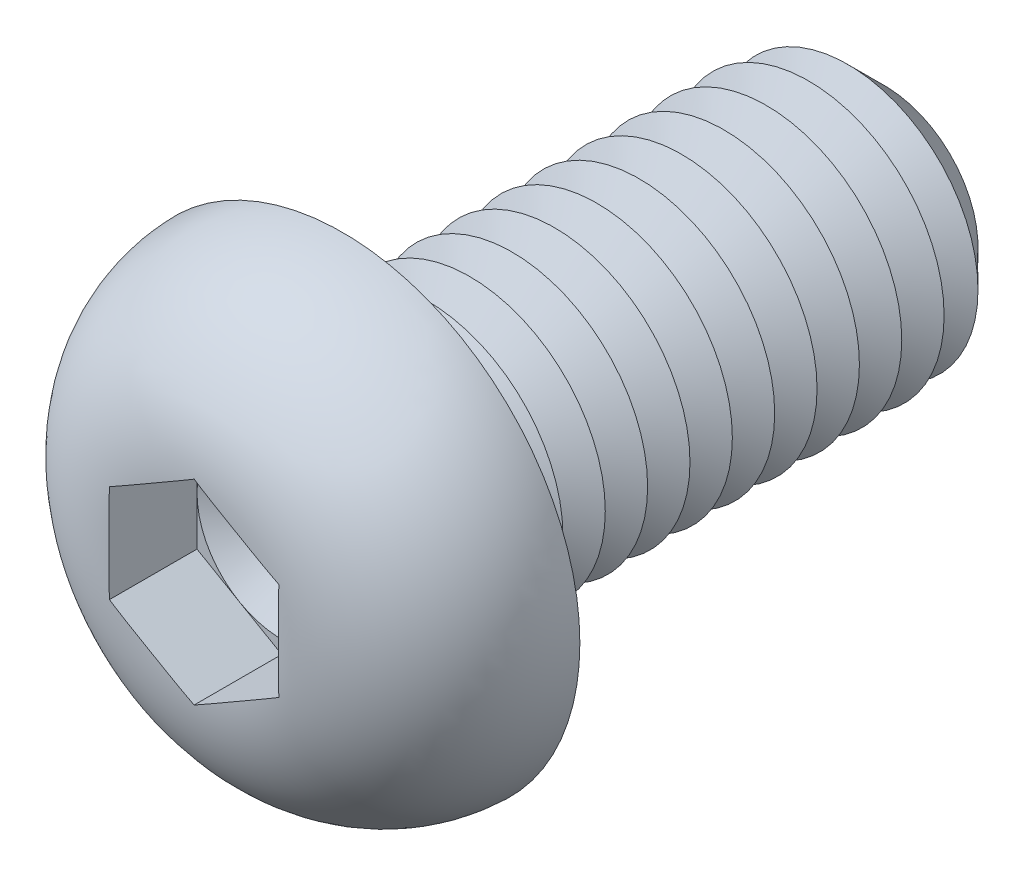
ISO-10303-21;
HEADER;
FILE_DESCRIPTION(('STEP AP214'),'2;1');
FILE_NAME('part.step','',(''),(''),'','','');
FILE_SCHEMA(('AUTOMOTIVE_DESIGN { 1 0 10303 214 1 1 1 1 }'));
ENDSEC;
DATA;
#1=APPLICATION_CONTEXT('core data for automotive mechanical design processes');
#2=APPLICATION_PROTOCOL_DEFINITION('international standard','automotive_design',2000,#1);
#3=PRODUCT_CONTEXT('',#1,'mechanical');
#4=PRODUCT('Part','Part','',(#3));
#5=PRODUCT_RELATED_PRODUCT_CATEGORY('part','',(#4));
#6=PRODUCT_DEFINITION_FORMATION('','',#4);
#7=PRODUCT_DEFINITION_CONTEXT('part definition',#1,'design');
#8=PRODUCT_DEFINITION('design','',#6,#7);
#9=PRODUCT_DEFINITION_SHAPE('','',#8);
#10=(LENGTH_UNIT() NAMED_UNIT(*) SI_UNIT(.MILLI.,.METRE.));
#11=(NAMED_UNIT(*) PLANE_ANGLE_UNIT() SI_UNIT($,.RADIAN.));
#12=(NAMED_UNIT(*) SI_UNIT($,.STERADIAN.) SOLID_ANGLE_UNIT());
#13=UNCERTAINTY_MEASURE_WITH_UNIT(LENGTH_MEASURE(1.E-05),#10,'distance_accuracy_value','');
#14=(GEOMETRIC_REPRESENTATION_CONTEXT(3) GLOBAL_UNCERTAINTY_ASSIGNED_CONTEXT((#13)) GLOBAL_UNIT_ASSIGNED_CONTEXT((#10,
#11,#12)) REPRESENTATION_CONTEXT('',''));
#15=CARTESIAN_POINT('',(0.,0.,0.));
#16=DIRECTION('',(0.,0.,1.));
#17=DIRECTION('',(1.,0.,0.));
#18=AXIS2_PLACEMENT_3D('',#15,#16,#17);
#19=CARTESIAN_POINT('',(0.,0.,1.8));
#20=DIRECTION('',(0.,0.,1.));
#21=DIRECTION('',(1.,0.,0.));
#22=AXIS2_PLACEMENT_3D('',#19,#20,#21);
#23=PLANE('',#22);
#24=CARTESIAN_POINT('',(0.,0.,1.8));
#25=DIRECTION('',(0.,0.,1.));
#26=DIRECTION('',(1.,0.,0.));
#27=AXIS2_PLACEMENT_3D('',#24,#25,#26);
#28=CIRCLE('',#27,2.5);
#29=CARTESIAN_POINT('',(2.5,0.,1.8));
#30=VERTEX_POINT('',#29);
#31=CARTESIAN_POINT('',(1.25,2.1650635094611,1.8));
#32=VERTEX_POINT('',#31);
#33=EDGE_CURVE('E153',#30,#32,#28,.T.);
#34=ORIENTED_EDGE('',*,*,#33,.F.);
#35=DIRECTION('',(0.,1.,0.));
#36=VECTOR('',#35,1.);
#37=CARTESIAN_POINT('',(2.5,-1.44337567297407,1.8));
#38=LINE('',#37,#36);
#39=CARTESIAN_POINT('',(2.5,1.44337567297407,1.8));
#40=VERTEX_POINT('',#39);
#41=EDGE_CURVE('E176',#30,#40,#38,.T.);
#42=ORIENTED_EDGE('',*,*,#41,.T.);
#43=DIRECTION('',(-0.866025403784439,0.5,0.));
#44=VECTOR('',#43,1.);
#45=CARTESIAN_POINT('',(2.5,1.44337567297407,1.8));
#46=LINE('',#45,#44);
#47=EDGE_CURVE('E172',#40,#32,#46,.T.);
#48=ORIENTED_EDGE('',*,*,#47,.T.);
#49=EDGE_LOOP('',(#34,#42,#48));
#50=FACE_BOUND('',#49,.T.);
#51=ADVANCED_FACE('F39',(#50),#23,.T.);
#52=CARTESIAN_POINT('',(0.,0.,1.8));
#53=DIRECTION('',(0.,0.,1.));
#54=DIRECTION('',(1.,0.,0.));
#55=AXIS2_PLACEMENT_3D('',#52,#53,#54);
#56=CIRCLE('',#55,2.5);
#57=CARTESIAN_POINT('',(-1.25,2.1650635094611,1.8));
#58=VERTEX_POINT('',#57);
#59=EDGE_CURVE('E11',#32,#58,#56,.T.);
#60=ORIENTED_EDGE('',*,*,#59,.F.);
#61=CARTESIAN_POINT('',(0.,2.88675134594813,1.8));
#62=VERTEX_POINT('',#61);
#63=EDGE_CURVE('E166',#32,#62,#46,.T.);
#64=ORIENTED_EDGE('',*,*,#63,.T.);
#65=DIRECTION('',(-0.866025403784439,-0.5,0.));
#66=VECTOR('',#65,1.);
#67=CARTESIAN_POINT('',(0.,2.88675134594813,1.8));
#68=LINE('',#67,#66);
#69=EDGE_CURVE('E167',#62,#58,#68,.T.);
#70=ORIENTED_EDGE('',*,*,#69,.T.);
#71=EDGE_LOOP('',(#60,#64,#70));
#72=FACE_BOUND('',#71,.T.);
#73=ADVANCED_FACE('F165',(#72),#23,.T.);
#74=CARTESIAN_POINT('',(-2.5,0.,1.8));
#75=VERTEX_POINT('',#74);
#76=EDGE_CURVE('E49',#58,#75,#56,.T.);
#77=ORIENTED_EDGE('',*,*,#76,.F.);
#78=CARTESIAN_POINT('',(-2.5,1.44337567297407,1.8));
#79=VERTEX_POINT('',#78);
#80=EDGE_CURVE('E179',#58,#79,#68,.T.);
#81=ORIENTED_EDGE('',*,*,#80,.T.);
#82=DIRECTION('',(0.,-1.,0.));
#83=VECTOR('',#82,1.);
#84=CARTESIAN_POINT('',(-2.5,1.44337567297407,1.8));
#85=LINE('',#84,#83);
#86=EDGE_CURVE('E190',#79,#75,#85,.T.);
#87=ORIENTED_EDGE('',*,*,#86,.T.);
#88=EDGE_LOOP('',(#77,#81,#87));
#89=FACE_BOUND('',#88,.T.);
#90=ADVANCED_FACE('F447',(#89),#23,.T.);
#91=CARTESIAN_POINT('',(-1.25,-2.1650635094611,1.8));
#92=VERTEX_POINT('',#91);
#93=EDGE_CURVE('E428',#75,#92,#56,.T.);
#94=ORIENTED_EDGE('',*,*,#93,.F.);
#95=CARTESIAN_POINT('',(-2.5,-1.44337567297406,1.8));
#96=VERTEX_POINT('',#95);
#97=EDGE_CURVE('E189',#75,#96,#85,.T.);
#98=ORIENTED_EDGE('',*,*,#97,.T.);
#99=DIRECTION('',(0.866025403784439,-0.5,0.));
#100=VECTOR('',#99,1.);
#101=CARTESIAN_POINT('',(-2.5,-1.44337567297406,1.8));
#102=LINE('',#101,#100);
#103=EDGE_CURVE('E195',#96,#92,#102,.T.);
#104=ORIENTED_EDGE('',*,*,#103,.T.);
#105=EDGE_LOOP('',(#94,#98,#104));
#106=FACE_BOUND('',#105,.T.);
#107=ADVANCED_FACE('F441',(#106),#23,.T.);
#108=CARTESIAN_POINT('',(1.25,-2.1650635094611,1.8));
#109=VERTEX_POINT('',#108);
#110=EDGE_CURVE('E56',#92,#109,#56,.T.);
#111=ORIENTED_EDGE('',*,*,#110,.F.);
#112=CARTESIAN_POINT('',(0.,-2.88675134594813,1.8));
#113=VERTEX_POINT('',#112);
#114=EDGE_CURVE('E194',#92,#113,#102,.T.);
#115=ORIENTED_EDGE('',*,*,#114,.T.);
#116=DIRECTION('',(0.866025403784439,0.5,0.));
#117=VECTOR('',#116,1.);
#118=CARTESIAN_POINT('',(0.,-2.88675134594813,1.8));
#119=LINE('',#118,#117);
#120=EDGE_CURVE('E200',#113,#109,#119,.T.);
#121=ORIENTED_EDGE('',*,*,#120,.T.);
#122=EDGE_LOOP('',(#111,#115,#121));
#123=FACE_BOUND('',#122,.T.);
#124=ADVANCED_FACE('F480',(#123),#23,.T.);
#125=CARTESIAN_POINT('',(0.,0.,-16.));
#126=DIRECTION('',(0.,0.,1.));
#127=DIRECTION('',(1.,0.,0.));
#128=AXIS2_PLACEMENT_3D('',#125,#126,#127);
#129=CYLINDRICAL_SURFACE('',#128,4.);
#130=CARTESIAN_POINT('',(0.,0.,-0.5));
#131=DIRECTION('',(0.,0.,1.));
#132=DIRECTION('',(1.,0.,0.));
#133=AXIS2_PLACEMENT_3D('',#130,#131,#132);
#134=CIRCLE('',#133,4.);
#135=CARTESIAN_POINT('',(4.,0.,-0.5));
#136=VERTEX_POINT('',#135);
#137=EDGE_CURVE('E411',#136,#136,#134,.F.);
#138=ORIENTED_EDGE('',*,*,#137,.T.);
#139=EDGE_LOOP('',(#138));
#140=FACE_BOUND('',#139,.T.);
#141=CARTESIAN_POINT('',(0.,0.,-1.25));
#142=DIRECTION('',(0.,0.,1.));
#143=DIRECTION('',(1.,0.,0.));
#144=AXIS2_PLACEMENT_3D('',#141,#142,#143);
#145=CIRCLE('',#144,4.00000000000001);
#146=CARTESIAN_POINT('',(4.00000000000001,0.,-1.25));
#147=VERTEX_POINT('',#146);
#148=EDGE_CURVE('E185',#147,#147,#145,.T.);
#149=ORIENTED_EDGE('',*,*,#148,.T.);
#150=EDGE_LOOP('',(#149));
#151=FACE_BOUND('',#150,.T.);
#152=ADVANCED_FACE('F475',(#140,#151),#129,.T.);
#153=CARTESIAN_POINT('',(0.,7.,0.));
#154=DIRECTION('',(0.,0.,1.));
#155=DIRECTION('',(1.,0.,0.));
#156=AXIS2_PLACEMENT_3D('',#153,#154,#155);
#157=PLANE('',#156);
#158=CARTESIAN_POINT('',(0.,0.,0.));
#159=DIRECTION('',(0.,0.,1.));
#160=DIRECTION('',(1.,0.,0.));
#161=AXIS2_PLACEMENT_3D('',#158,#159,#160);
#162=CIRCLE('',#161,4.5);
#163=CARTESIAN_POINT('',(4.5,0.,0.));
#164=VERTEX_POINT('',#163);
#165=EDGE_CURVE('E420',#164,#164,#162,.T.);
#166=ORIENTED_EDGE('',*,*,#165,.T.);
#167=EDGE_LOOP('',(#166));
#168=FACE_BOUND('',#167,.T.);
#169=CARTESIAN_POINT('',(0.,0.,0.));
#170=DIRECTION('',(0.,0.,1.));
#171=DIRECTION('',(1.,0.,0.));
#172=AXIS2_PLACEMENT_3D('',#169,#170,#171);
#173=CIRCLE('',#172,7.);
#174=CARTESIAN_POINT('',(7.,0.,0.));
#175=VERTEX_POINT('',#174);
#176=EDGE_CURVE('E211',#175,#175,#173,.T.);
#177=ORIENTED_EDGE('',*,*,#176,.F.);
#178=EDGE_LOOP('',(#177));
#179=FACE_BOUND('',#178,.T.);
#180=ADVANCED_FACE('F473',(#168,#179),#157,.F.);
#181=CARTESIAN_POINT('',(0.,0.,-0.1));
#182=DIRECTION('',(0.,0.,1.));
#183=DIRECTION('',(1.,0.,0.));
#184=AXIS2_PLACEMENT_3D('',#181,#182,#183);
#185=DEGENERATE_TOROIDAL_SURFACE('',#184,2.5011112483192,4.5,.T.);
#186=CARTESIAN_POINT('',(1.31456088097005,2.12778926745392,4.4));
#187=DIRECTION('',(-0.866025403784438,0.500000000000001,0.));
#188=VECTOR('',#187,1.);
#189=LINE('',#186,#188);
#190=CARTESIAN_POINT('',(1.31456088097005,2.12778926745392,4.4));
#191=VERTEX_POINT('',#190);
#192=CARTESIAN_POINT('',(1.18543911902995,2.20233775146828,4.4));
#193=VERTEX_POINT('',#192);
#194=EDGE_CURVE('E399',#191,#193,#189,.T.);
#195=ORIENTED_EDGE('',*,*,#194,.F.);
#196=CARTESIAN_POINT('',(-0.000200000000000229,2.88686681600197,4.38343536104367));
#197=CARTESIAN_POINT('',(0.103935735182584,2.82674402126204,4.38859262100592));
#198=CARTESIAN_POINT('',(0.208111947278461,2.76659785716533,4.39207570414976));
#199=CARTESIAN_POINT('',(0.416486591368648,2.64629270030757,4.39683754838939));
#200=CARTESIAN_POINT('',(0.520685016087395,2.58613371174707,4.39811670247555));
#201=CARTESIAN_POINT('',(0.729066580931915,2.46582455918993,4.3996156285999));
#202=CARTESIAN_POINT('',(0.833249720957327,2.40567439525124,4.39983556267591));
#203=CARTESIAN_POINT('',(1.04162190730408,2.2853706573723,4.4000276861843));
#204=CARTESIAN_POINT('',(1.14581095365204,2.2252170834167,4.39999986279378));
#205=CARTESIAN_POINT('',(1.35418904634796,2.10490993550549,4.39999986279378));
#206=CARTESIAN_POINT('',(1.45837809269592,2.04475636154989,4.4000276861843));
#207=CARTESIAN_POINT('',(1.66675027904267,1.92445262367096,4.39983556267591));
#208=CARTESIAN_POINT('',(1.77093341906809,1.86430245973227,4.3996156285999));
#209=CARTESIAN_POINT('',(1.97931498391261,1.74399330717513,4.39811670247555));
#210=CARTESIAN_POINT('',(2.08351340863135,1.68383431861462,4.39683754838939));
#211=CARTESIAN_POINT('',(2.29188805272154,1.56352916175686,4.39207570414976));
#212=CARTESIAN_POINT('',(2.39606426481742,1.50338299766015,4.38859262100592));
#213=CARTESIAN_POINT('',(2.5002,1.44326020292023,4.38343536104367));
#214=B_SPLINE_CURVE_WITH_KNOTS('',3,(#196,#197,#198,#199,#200,#201,#202,#203,#204,#205,#206,
#207,#208,#209,#210,#211,#212,#213),.UNSPECIFIED.,.F.,.F.,(4,2,2,2,2,2,2,2,4),(0.,
0.361022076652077,0.721979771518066,1.08288224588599,1.44380339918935,1.80472455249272,
2.16562702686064,2.52658472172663,2.88760679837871),.UNSPECIFIED.);
#215=CARTESIAN_POINT('',(2.5,1.44337567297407,4.38344529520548));
#216=VERTEX_POINT('',#215);
#217=EDGE_CURVE('E355',#191,#216,#214,.T.);
#218=ORIENTED_EDGE('',*,*,#217,.T.);
#219=CARTESIAN_POINT('',(2.5,0.,4.39999986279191));
#220=CARTESIAN_POINT('',(2.5,-0.104697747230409,4.39999811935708));
#221=CARTESIAN_POINT('',(2.5,-0.209395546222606,4.40001551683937));
#222=CARTESIAN_POINT('',(2.5,-0.418792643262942,4.39990807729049));
#223=CARTESIAN_POINT('',(2.5,-0.52349194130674,4.39978323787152));
#224=CARTESIAN_POINT('',(2.5,-0.732936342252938,4.39891238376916));
#225=CARTESIAN_POINT('',(2.5,-0.837681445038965,4.39816609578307));
#226=CARTESIAN_POINT('',(2.5,-1.04715282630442,4.39536239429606));
#227=CARTESIAN_POINT('',(2.5,-1.15187910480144,4.39330498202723));
#228=CARTESIAN_POINT('',(2.5,-1.46476484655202,4.38400647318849));
#229=CARTESIAN_POINT('',(2.5,-1.67286375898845,4.37365196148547));
#230=CARTESIAN_POINT('',(2.5,-2.08783281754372,4.33852954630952));
#231=CARTESIAN_POINT('',(2.5,-2.29470379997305,4.31377296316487));
#232=CARTESIAN_POINT('',(2.5,-2.64451002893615,4.25536510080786));
#233=CARTESIAN_POINT('',(2.5,-2.78823975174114,4.22651785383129));
#234=CARTESIAN_POINT('',(2.5,-3.073224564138,4.15827060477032));
#235=CARTESIAN_POINT('',(2.5,-3.21447933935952,4.11886927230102));
#236=CARTESIAN_POINT('',(2.5,-3.49353952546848,4.02870287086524));
#237=CARTESIAN_POINT('',(2.5,-3.6313402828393,3.97792330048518));
#238=CARTESIAN_POINT('',(2.5,-3.90204977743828,3.86463774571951));
#239=CARTESIAN_POINT('',(2.5,-4.0349587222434,3.8021322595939));
#240=CARTESIAN_POINT('',(2.5,-4.2956525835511,3.66474880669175));
#241=CARTESIAN_POINT('',(2.5,-4.42338586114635,3.58977252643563));
#242=CARTESIAN_POINT('',(2.5,-4.67118559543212,3.42803136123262));
#243=CARTESIAN_POINT('',(2.5,-4.79125159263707,3.3412657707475));
#244=CARTESIAN_POINT('',(2.5,-5.02233156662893,3.15645800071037));
#245=CARTESIAN_POINT('',(2.5,-5.13334771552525,3.05841854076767));
#246=CARTESIAN_POINT('',(2.5,-5.34506083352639,2.85177471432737));
#247=CARTESIAN_POINT('',(2.5,-5.44575933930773,2.74317192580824));
#248=CARTESIAN_POINT('',(2.5,-5.62335564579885,2.53102225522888));
#249=CARTESIAN_POINT('',(2.5,-5.70164721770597,2.42863868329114));
#250=CARTESIAN_POINT('',(2.5,-5.84882394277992,2.21725758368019));
#251=CARTESIAN_POINT('',(2.5,-5.91770588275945,2.10825781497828));
#252=CARTESIAN_POINT('',(2.5,-6.04532926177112,1.88460009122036));
#253=CARTESIAN_POINT('',(2.5,-6.1040794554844,1.76994713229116));
#254=CARTESIAN_POINT('',(2.5,-6.21098181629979,1.53574793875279));
#255=CARTESIAN_POINT('',(2.5,-6.25913021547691,1.41619998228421));
#256=CARTESIAN_POINT('',(2.5,-6.34173830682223,1.18065209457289));
#257=CARTESIAN_POINT('',(2.5,-6.37685491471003,1.06488207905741));
#258=CARTESIAN_POINT('',(2.5,-6.43703913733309,0.830714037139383));
#259=CARTESIAN_POINT('',(2.5,-6.46210319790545,0.712315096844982));
#260=CARTESIAN_POINT('',(2.5,-6.50194044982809,0.473848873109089));
#261=CARTESIAN_POINT('',(2.5,-6.51671856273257,0.353782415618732));
#262=CARTESIAN_POINT('',(2.5,-6.53588982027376,0.112808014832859));
#263=CARTESIAN_POINT('',(2.5,-6.54027911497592,-0.00810022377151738));
#264=CARTESIAN_POINT('',(2.5,-6.53779027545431,-0.365870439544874));
#265=CARTESIAN_POINT('',(2.5,-6.51607942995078,-0.602790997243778));
#266=CARTESIAN_POINT('',(2.5,-6.43310265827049,-1.06957107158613));
#267=CARTESIAN_POINT('',(2.5,-6.3718398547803,-1.29943114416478));
#268=CARTESIAN_POINT('',(2.5,-6.25195024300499,-1.63390601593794));
#269=CARTESIAN_POINT('',(2.5,-6.20730237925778,-1.74371189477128));
#270=CARTESIAN_POINT('',(2.5,-6.10902350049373,-1.95921136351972));
#271=CARTESIAN_POINT('',(2.5,-6.05539567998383,-2.06490639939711));
#272=CARTESIAN_POINT('',(2.5,-5.93955620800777,-2.27152527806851));
#273=CARTESIAN_POINT('',(2.5,-5.87734126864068,-2.37244727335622));
#274=CARTESIAN_POINT('',(2.5,-5.7448545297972,-2.56880727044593));
#275=CARTESIAN_POINT('',(2.5,-5.67458537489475,-2.6642470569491));
#276=CARTESIAN_POINT('',(2.5,-5.52523018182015,-2.85070592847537));
#277=CARTESIAN_POINT('',(2.5,-5.44601185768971,-2.94161901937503));
#278=CARTESIAN_POINT('',(2.5,-5.28044044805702,-3.11663859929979));
#279=CARTESIAN_POINT('',(2.5,-5.194089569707,-3.2007471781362));
#280=CARTESIAN_POINT('',(2.5,-5.01485870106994,-3.36178408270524));
#281=CARTESIAN_POINT('',(2.5,-4.92197538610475,-3.43870870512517));
#282=CARTESIAN_POINT('',(2.5,-4.73045535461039,-3.58495812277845));
#283=CARTESIAN_POINT('',(2.5,-4.6318202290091,-3.65428500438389));
#284=CARTESIAN_POINT('',(2.5,-4.4247626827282,-3.78818551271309));
#285=CARTESIAN_POINT('',(2.5,-4.31609824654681,-3.85238474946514));
#286=CARTESIAN_POINT('',(2.5,-4.0940582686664,-3.97208975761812));
#287=CARTESIAN_POINT('',(2.5,-3.98068153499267,-4.02759331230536));
#288=CARTESIAN_POINT('',(2.5,-3.75029026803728,-4.12981004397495));
#289=CARTESIAN_POINT('',(2.5,-3.63328275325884,-4.17653908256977));
#290=CARTESIAN_POINT('',(2.5,-3.39631992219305,-4.2614893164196));
#291=CARTESIAN_POINT('',(2.5,-3.27636651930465,-4.29971587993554));
#292=CARTESIAN_POINT('',(2.5,-3.00446622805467,-4.37644925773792));
#293=CARTESIAN_POINT('',(2.5,-2.85188931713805,-4.41272455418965));
#294=CARTESIAN_POINT('',(2.5,-2.54443794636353,-4.47385449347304));
#295=CARTESIAN_POINT('',(2.5,-2.3895624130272,-4.49870361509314));
#296=CARTESIAN_POINT('',(2.5,-2.07807451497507,-4.53870829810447));
#297=CARTESIAN_POINT('',(2.5,-1.92145805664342,-4.55383091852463));
#298=CARTESIAN_POINT('',(2.5,-1.60772330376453,-4.57647936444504));
#299=CARTESIAN_POINT('',(2.5,-1.45060502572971,-4.58400543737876));
#300=CARTESIAN_POINT('',(2.5,-1.13432460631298,-4.59416656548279));
#301=CARTESIAN_POINT('',(2.5,-0.975160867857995,-4.59674096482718));
#302=CARTESIAN_POINT('',(2.5,-0.656826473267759,-4.59957813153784));
#303=CARTESIAN_POINT('',(2.5,-0.497655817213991,-4.59984092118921));
#304=CARTESIAN_POINT('',(2.5,-0.179547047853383,-4.60005428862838));
#305=CARTESIAN_POINT('',(2.5,-0.02060893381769,-4.60000532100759));
#306=CARTESIAN_POINT('',(2.5,0.297265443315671,-4.59999304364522));
#307=CARTESIAN_POINT('',(2.5,0.456201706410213,-4.60002973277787));
#308=CARTESIAN_POINT('',(2.5,0.70967559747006,-4.59902611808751));
#309=CARTESIAN_POINT('',(2.5,0.804213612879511,-4.59841616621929));
#310=CARTESIAN_POINT('',(2.5,0.99327694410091,-4.59620676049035));
#311=CARTESIAN_POINT('',(2.5,1.08780225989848,-4.59460730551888));
#312=CARTESIAN_POINT('',(2.5,1.37137837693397,-4.58746770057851));
#313=CARTESIAN_POINT('',(2.5,1.56039301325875,-4.57958602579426));
#314=CARTESIAN_POINT('',(2.5,1.93609462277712,-4.55305686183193));
#315=CARTESIAN_POINT('',(2.5,2.12278756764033,-4.53450331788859));
#316=CARTESIAN_POINT('',(2.5,2.49421016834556,-4.48296248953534));
#317=CARTESIAN_POINT('',(2.5,2.67894050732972,-4.44998040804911));
#318=CARTESIAN_POINT('',(2.5,2.99962701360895,-4.37718406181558));
#319=CARTESIAN_POINT('',(2.5,3.13641465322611,-4.34103978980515));
#320=CARTESIAN_POINT('',(2.5,3.40682838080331,-4.25834226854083));
#321=CARTESIAN_POINT('',(2.5,3.54045461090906,-4.21178948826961));
#322=CARTESIAN_POINT('',(2.5,3.80387940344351,-4.1076796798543));
#323=CARTESIAN_POINT('',(2.5,3.93366385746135,-4.05008679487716));
#324=CARTESIAN_POINT('',(2.5,4.18776789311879,-3.92385886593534));
#325=CARTESIAN_POINT('',(2.5,4.31208736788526,-3.85522360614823));
#326=CARTESIAN_POINT('',(2.5,4.55475418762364,-3.70660227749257));
#327=CARTESIAN_POINT('',(2.5,4.67306276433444,-3.62655275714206));
#328=CARTESIAN_POINT('',(2.5,4.90171316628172,-3.45576294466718));
#329=CARTESIAN_POINT('',(2.5,5.01205476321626,-3.36502234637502));
#330=CARTESIAN_POINT('',(2.5,5.22347091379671,-3.17353376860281));
#331=CARTESIAN_POINT('',(2.5,5.32455555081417,-3.07279693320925));
#332=CARTESIAN_POINT('',(2.5,5.51647993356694,-2.86200023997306));
#333=CARTESIAN_POINT('',(2.5,5.6073208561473,-2.75194145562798));
#334=CARTESIAN_POINT('',(2.5,5.76832451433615,-2.53607083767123));
#335=CARTESIAN_POINT('',(2.5,5.83966300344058,-2.4311337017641));
#336=CARTESIAN_POINT('',(2.5,5.97282702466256,-2.2153291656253));
#337=CARTESIAN_POINT('',(2.5,6.03464926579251,-2.10445973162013));
#338=CARTESIAN_POINT('',(2.5,6.14815657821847,-1.87771731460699));
#339=CARTESIAN_POINT('',(2.5,6.19984675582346,-1.76184688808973));
#340=CARTESIAN_POINT('',(2.5,6.29267395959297,-1.52590109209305));
#341=CARTESIAN_POINT('',(2.5,6.33380720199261,-1.40582423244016));
#342=CARTESIAN_POINT('',(2.5,6.40328888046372,-1.16869740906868));
#343=CARTESIAN_POINT('',(2.5,6.43218419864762,-1.05180738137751));
#344=CARTESIAN_POINT('',(2.5,6.47988151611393,-0.815941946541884));
#345=CARTESIAN_POINT('',(2.5,6.49867991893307,-0.696965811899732));
#346=CARTESIAN_POINT('',(2.5,6.52599950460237,-0.457898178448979));
#347=CARTESIAN_POINT('',(2.5,6.53452634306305,-0.337807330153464));
#348=CARTESIAN_POINT('',(2.5,6.54126106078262,-0.0973214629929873));
#349=CARTESIAN_POINT('',(2.5,6.5394651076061,0.023073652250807));
#350=CARTESIAN_POINT('',(2.5,6.51879545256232,0.379398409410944));
#351=CARTESIAN_POINT('',(2.5,6.48510560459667,0.614630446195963));
#352=CARTESIAN_POINT('',(2.5,6.37872360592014,1.07608887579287));
#353=CARTESIAN_POINT('',(2.5,6.30603128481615,1.3023152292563));
#354=CARTESIAN_POINT('',(2.5,6.16957161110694,1.63028303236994));
#355=CARTESIAN_POINT('',(2.5,6.11941470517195,1.7378698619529));
#356=CARTESIAN_POINT('',(2.5,6.01034124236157,1.94849153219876));
#357=CARTESIAN_POINT('',(2.5,5.9514277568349,2.05152795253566));
#358=CARTESIAN_POINT('',(2.5,5.82528890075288,2.25240256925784));
#359=CARTESIAN_POINT('',(2.5,5.75806159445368,2.35023954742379));
#360=CARTESIAN_POINT('',(2.5,5.61585543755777,2.54005689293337));
#361=CARTESIAN_POINT('',(2.5,5.54087908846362,2.63203913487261));
#362=CARTESIAN_POINT('',(2.5,5.38212190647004,2.81146438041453));
#363=CARTESIAN_POINT('',(2.5,5.29819182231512,2.89877528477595));
#364=CARTESIAN_POINT('',(2.5,5.12353712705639,3.06625194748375));
#365=CARTESIAN_POINT('',(2.5,5.03281455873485,3.14641983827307));
#366=CARTESIAN_POINT('',(2.5,4.84518171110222,3.29930665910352));
#367=CARTESIAN_POINT('',(2.5,4.74826657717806,3.37201962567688));
#368=CARTESIAN_POINT('',(2.5,4.54907485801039,3.50961479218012));
#369=CARTESIAN_POINT('',(2.5,4.44679969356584,3.57449905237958));
#370=CARTESIAN_POINT('',(2.5,4.23202545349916,3.69953578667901));
#371=CARTESIAN_POINT('',(2.5,4.11927203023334,3.75925114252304));
#372=CARTESIAN_POINT('',(2.5,3.88947986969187,3.86977617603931));
#373=CARTESIAN_POINT('',(2.5,3.77244067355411,3.92058489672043));
#374=CARTESIAN_POINT('',(2.5,3.5351804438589,4.0133148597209));
#375=CARTESIAN_POINT('',(2.5,3.41496637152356,4.0552539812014));
#376=CARTESIAN_POINT('',(2.5,3.17195278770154,4.13067246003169));
#377=CARTESIAN_POINT('',(2.5,3.04915378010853,4.16415344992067));
#378=CARTESIAN_POINT('',(2.5,2.80683027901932,4.22194717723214));
#379=CARTESIAN_POINT('',(2.5,2.68738216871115,4.2465834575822));
#380=CARTESIAN_POINT('',(2.5,2.44729214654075,4.28920746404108));
#381=CARTESIAN_POINT('',(2.5,2.32664997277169,4.30719369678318));
#382=CARTESIAN_POINT('',(2.5,2.08450864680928,4.33736171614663));
#383=CARTESIAN_POINT('',(2.5,1.9630086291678,4.3495363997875));
#384=CARTESIAN_POINT('',(2.5,1.71961501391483,4.36908103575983));
#385=CARTESIAN_POINT('',(2.5,1.59772134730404,4.37645009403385));
#386=CARTESIAN_POINT('',(2.5,1.35283283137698,4.38761579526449));
#387=CARTESIAN_POINT('',(2.5,1.22983679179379,4.39138420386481));
#388=CARTESIAN_POINT('',(2.5,0.983808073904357,4.3965493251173));
#389=CARTESIAN_POINT('',(2.5,0.860775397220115,4.3979461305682));
#390=CARTESIAN_POINT('',(2.5,0.614783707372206,4.39958107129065));
#391=CARTESIAN_POINT('',(2.5,0.491824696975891,4.3998199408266));
#392=CARTESIAN_POINT('',(2.5,0.245910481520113,4.40003035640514));
#393=CARTESIAN_POINT('',(2.5,0.122955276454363,4.4000019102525));
#394=CARTESIAN_POINT('',(2.5,0.,4.39999986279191));
#395=B_SPLINE_CURVE_WITH_KNOTS('',3,(#219,#220,#221,#222,#223,#224,#225,#226,#227,#228,#229,
#230,#231,#232,#233,#234,#235,#236,#237,#238,#239,#240,#241,#242,#243,#244,#245,#246,#247,#248,
#249,#250,#251,#252,#253,#254,#255,#256,#257,#258,#259,#260,#261,#262,#263,#264,#265,#266,#267,
#268,#269,#270,#271,#272,#273,#274,#275,#276,#277,#278,#279,#280,#281,#282,#283,#284,#285,#286,
#287,#288,#289,#290,#291,#292,#293,#294,#295,#296,#297,#298,#299,#300,#301,#302,#303,#304,#305,
#306,#307,#308,#309,#310,#311,#312,#313,#314,#315,#316,#317,#318,#319,#320,#321,#322,#323,#324,
#325,#326,#327,#328,#329,#330,#331,#332,#333,#334,#335,#336,#337,#338,#339,#340,#341,#342,#343,
#344,#345,#346,#347,#348,#349,#350,#351,#352,#353,#354,#355,#356,#357,#358,#359,#360,#361,#362,
#363,#364,#365,#366,#367,#368,#369,#370,#371,#372,#373,#374,#375,#376,#377,#378,#379,#380,#381,
#382,#383,#384,#385,#386,#387,#388,#389,#390,#391,#392,#393,#394),.UNSPECIFIED.,.T.,.F.,(4,2,2,
2,2,2,2,2,2,2,2,2,2,2,2,2,2,2,2,2,2,2,2,2,2,2,2,2,2,2,2,2,2,2,2,2,2,2,2,2,2,2,2,2,2,2,2,2,2,2,2,
2,2,2,2,2,2,2,2,2,2,2,2,2,2,2,2,2,2,2,2,2,2,2,2,2,2,2,2,2,2,2,2,2,2,2,2,4),(0.,
0.314093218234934,0.62819170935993,0.942428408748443,1.25666481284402,1.88144147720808,
2.50572771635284,2.94516878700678,3.38466527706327,3.82472511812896,4.26476626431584,
4.70845695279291,5.15217420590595,5.59578464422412,6.03932891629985,6.42549664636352,
6.81179591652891,7.19775970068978,7.58386043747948,7.94635637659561,8.30898036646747,
8.67143073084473,9.03401539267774,9.74414367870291,10.4542159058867,10.8094792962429,
11.1646165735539,11.5198902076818,11.8750475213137,12.2363927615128,12.597626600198,
12.9590456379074,13.3203651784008,13.698597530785,14.0769261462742,14.4545641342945,
14.8319630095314,15.3019396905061,15.7721432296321,16.2439309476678,16.715703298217,
17.1932187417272,17.6707295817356,18.1475442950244,18.6243527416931,18.9079682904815,
19.1915841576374,19.7589248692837,20.3213460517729,20.8835645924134,21.3076400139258,
21.731696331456,22.1571540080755,22.5826200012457,23.0105507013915,23.4384936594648,
23.8659647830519,24.2933867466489,24.6735755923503,25.0538956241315,25.4340234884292,
25.8142874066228,26.1750761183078,26.5359932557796,26.8967115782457,27.2575638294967,
27.9668653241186,28.6761699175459,29.0319382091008,29.3875820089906,29.7433087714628,
30.0989210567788,30.4618400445,30.8246503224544,31.1877485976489,31.5507511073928,
31.9331198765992,32.3155297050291,32.6971611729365,33.0787189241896,33.4443988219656,
33.8101607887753,34.1763686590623,34.54264464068,34.9117697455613,35.2808804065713,
35.6497569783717,36.0186227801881),.UNSPECIFIED.);
#396=CARTESIAN_POINT('',(2.5,0.0745484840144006,4.4));
#397=VERTEX_POINT('',#396);
#398=EDGE_CURVE('E345',#216,#397,#395,.T.);
#399=ORIENTED_EDGE('',*,*,#398,.T.);
#400=CARTESIAN_POINT('',(2.5,-0.0745484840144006,4.4));
#401=DIRECTION('',(0.,1.,0.));
#402=VECTOR('',#401,1.);
#403=LINE('',#400,#402);
#404=CARTESIAN_POINT('',(2.5,-0.0745484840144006,4.4));
#405=VERTEX_POINT('',#404);
#406=EDGE_CURVE('E174',#405,#397,#403,.T.);
#407=ORIENTED_EDGE('',*,*,#406,.F.);
#408=CARTESIAN_POINT('',(2.5,-1.44337567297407,4.38344529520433));
#409=VERTEX_POINT('',#408);
#410=EDGE_CURVE('E356',#405,#409,#395,.T.);
#411=ORIENTED_EDGE('',*,*,#410,.T.);
#412=CARTESIAN_POINT('',(2.5002,-1.44326020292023,4.38343536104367));
#413=CARTESIAN_POINT('',(2.39606426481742,-1.50338299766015,4.38859262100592));
#414=CARTESIAN_POINT('',(2.29188805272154,-1.56352916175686,4.39207570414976));
#415=CARTESIAN_POINT('',(2.08351340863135,-1.68383431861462,4.39683754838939));
#416=CARTESIAN_POINT('',(1.9793149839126,-1.74399330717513,4.39811670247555));
#417=CARTESIAN_POINT('',(1.77093341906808,-1.86430245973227,4.3996156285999));
#418=CARTESIAN_POINT('',(1.66675027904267,-1.92445262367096,4.39983556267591));
#419=CARTESIAN_POINT('',(1.45837809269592,-2.04475636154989,4.4000276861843));
#420=CARTESIAN_POINT('',(1.35418904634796,-2.10490993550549,4.39999986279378));
#421=CARTESIAN_POINT('',(1.14581095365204,-2.2252170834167,4.39999986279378));
#422=CARTESIAN_POINT('',(1.04162190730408,-2.2853706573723,4.4000276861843));
#423=CARTESIAN_POINT('',(0.833249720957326,-2.40567439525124,4.39983556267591));
#424=CARTESIAN_POINT('',(0.729066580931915,-2.46582455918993,4.3996156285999));
#425=CARTESIAN_POINT('',(0.520685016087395,-2.58613371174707,4.39811670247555));
#426=CARTESIAN_POINT('',(0.416486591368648,-2.64629270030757,4.39683754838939));
#427=CARTESIAN_POINT('',(0.208111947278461,-2.76659785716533,4.39207570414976));
#428=CARTESIAN_POINT('',(0.103935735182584,-2.82674402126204,4.38859262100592));
#429=CARTESIAN_POINT('',(-0.000200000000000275,-2.88686681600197,4.38343536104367));
#430=B_SPLINE_CURVE_WITH_KNOTS('',3,(#412,#413,#414,#415,#416,#417,#418,#419,#420,#421,#422,
#423,#424,#425,#426,#427,#428,#429),.UNSPECIFIED.,.F.,.F.,(4,2,2,2,2,2,2,2,4),(0.,
0.361022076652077,0.721979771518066,1.08288224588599,1.44380339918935,1.80472455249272,
2.16562702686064,2.52658472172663,2.88760679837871),.UNSPECIFIED.);
#431=CARTESIAN_POINT('',(1.31456088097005,-2.12778926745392,4.4));
#432=VERTEX_POINT('',#431);
#433=EDGE_CURVE('E332',#409,#432,#430,.T.);
#434=ORIENTED_EDGE('',*,*,#433,.T.);
#435=CARTESIAN_POINT('',(1.18543911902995,-2.20233775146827,4.4));
#436=DIRECTION('',(0.866025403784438,0.500000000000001,0.));
#437=VECTOR('',#436,1.);
#438=LINE('',#435,#437);
#439=CARTESIAN_POINT('',(1.18543911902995,-2.20233775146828,4.4));
#440=VERTEX_POINT('',#439);
#441=EDGE_CURVE('E341',#440,#432,#438,.T.);
#442=ORIENTED_EDGE('',*,*,#441,.F.);
#443=CARTESIAN_POINT('',(0.,-2.88675134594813,4.38344529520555));
#444=VERTEX_POINT('',#443);
#445=EDGE_CURVE('E295',#440,#444,#430,.T.);
#446=ORIENTED_EDGE('',*,*,#445,.T.);
#447=CARTESIAN_POINT('',(0.00019999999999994,-2.88686681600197,4.38343536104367));
#448=CARTESIAN_POINT('',(-0.103935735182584,-2.82674402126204,4.38859262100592));
#449=CARTESIAN_POINT('',(-0.208111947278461,-2.76659785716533,4.39207570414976));
#450=CARTESIAN_POINT('',(-0.416486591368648,-2.64629270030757,4.39683754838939));
#451=CARTESIAN_POINT('',(-0.520685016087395,-2.58613371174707,4.39811670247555));
#452=CARTESIAN_POINT('',(-0.729066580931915,-2.46582455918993,4.3996156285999));
#453=CARTESIAN_POINT('',(-0.833249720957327,-2.40567439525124,4.39983556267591));
#454=CARTESIAN_POINT('',(-1.04162190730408,-2.2853706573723,4.4000276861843));
#455=CARTESIAN_POINT('',(-1.14581095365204,-2.2252170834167,4.39999986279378));
#456=CARTESIAN_POINT('',(-1.35418904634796,-2.10490993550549,4.39999986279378));
#457=CARTESIAN_POINT('',(-1.45837809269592,-2.04475636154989,4.4000276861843));
#458=CARTESIAN_POINT('',(-1.66675027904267,-1.92445262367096,4.39983556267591));
#459=CARTESIAN_POINT('',(-1.77093341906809,-1.86430245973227,4.3996156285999));
#460=CARTESIAN_POINT('',(-1.97931498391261,-1.74399330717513,4.39811670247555));
#461=CARTESIAN_POINT('',(-2.08351340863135,-1.68383431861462,4.39683754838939));
#462=CARTESIAN_POINT('',(-2.29188805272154,-1.56352916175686,4.39207570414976));
#463=CARTESIAN_POINT('',(-2.39606426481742,-1.50338299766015,4.38859262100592));
#464=CARTESIAN_POINT('',(-2.5002,-1.44326020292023,4.38343536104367));
#465=B_SPLINE_CURVE_WITH_KNOTS('',3,(#447,#448,#449,#450,#451,#452,#453,#454,#455,#456,#457,
#458,#459,#460,#461,#462,#463,#464),.UNSPECIFIED.,.F.,.F.,(4,2,2,2,2,2,2,2,4),(0.,
0.361022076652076,0.721979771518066,1.08288224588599,1.44380339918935,1.80472455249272,
2.16562702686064,2.52658472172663,2.88760679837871),.UNSPECIFIED.);
#466=CARTESIAN_POINT('',(-1.18543911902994,-2.20233775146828,4.4));
#467=VERTEX_POINT('',#466);
#468=EDGE_CURVE('E285',#444,#467,#465,.T.);
#469=ORIENTED_EDGE('',*,*,#468,.T.);
#470=CARTESIAN_POINT('',(-1.31456088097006,-2.12778926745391,4.4));
#471=DIRECTION('',(0.86602540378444,-0.499999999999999,0.));
#472=VECTOR('',#471,1.);
#473=LINE('',#470,#472);
#474=CARTESIAN_POINT('',(-1.31456088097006,-2.12778926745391,4.4));
#475=VERTEX_POINT('',#474);
#476=EDGE_CURVE('E561',#475,#467,#473,.T.);
#477=ORIENTED_EDGE('',*,*,#476,.F.);
#478=CARTESIAN_POINT('',(-2.5,-1.44337567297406,4.38344529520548));
#479=VERTEX_POINT('',#478);
#480=EDGE_CURVE('E296',#475,#479,#465,.T.);
#481=ORIENTED_EDGE('',*,*,#480,.T.);
#482=CARTESIAN_POINT('',(-2.5,0.,4.39999986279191));
#483=CARTESIAN_POINT('',(-2.5,0.104697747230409,4.39999811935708));
#484=CARTESIAN_POINT('',(-2.5,0.209395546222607,4.40001551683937));
#485=CARTESIAN_POINT('',(-2.5,0.418792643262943,4.39990807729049));
#486=CARTESIAN_POINT('',(-2.5,0.523491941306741,4.39978323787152));
#487=CARTESIAN_POINT('',(-2.5,0.732936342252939,4.39891238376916));
#488=CARTESIAN_POINT('',(-2.5,0.837681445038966,4.39816609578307));
#489=CARTESIAN_POINT('',(-2.5,1.04715282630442,4.39536239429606));
#490=CARTESIAN_POINT('',(-2.5,1.15187910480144,4.39330498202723));
#491=CARTESIAN_POINT('',(-2.5,1.46476484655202,4.38400647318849));
#492=CARTESIAN_POINT('',(-2.5,1.67286375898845,4.37365196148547));
#493=CARTESIAN_POINT('',(-2.5,2.08783281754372,4.33852954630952));
#494=CARTESIAN_POINT('',(-2.5,2.29470379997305,4.31377296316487));
#495=CARTESIAN_POINT('',(-2.5,2.64451002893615,4.25536510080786));
#496=CARTESIAN_POINT('',(-2.5,2.78823975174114,4.22651785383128));
#497=CARTESIAN_POINT('',(-2.5,3.073224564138,4.15827060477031));
#498=CARTESIAN_POINT('',(-2.5,3.21447933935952,4.11886927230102));
#499=CARTESIAN_POINT('',(-2.5,3.49353952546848,4.02870287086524));
#500=CARTESIAN_POINT('',(-2.5,3.6313402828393,3.97792330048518));
#501=CARTESIAN_POINT('',(-2.5,3.90204977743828,3.8646377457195));
#502=CARTESIAN_POINT('',(-2.5,4.0349587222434,3.8021322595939));
#503=CARTESIAN_POINT('',(-2.5,4.2956525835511,3.66474880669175));
#504=CARTESIAN_POINT('',(-2.5,4.42338586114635,3.58977252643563));
#505=CARTESIAN_POINT('',(-2.5,4.67118559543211,3.42803136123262));
#506=CARTESIAN_POINT('',(-2.5,4.79125159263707,3.3412657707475));
#507=CARTESIAN_POINT('',(-2.5,5.02233156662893,3.15645800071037));
#508=CARTESIAN_POINT('',(-2.5,5.13334771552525,3.05841854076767));
#509=CARTESIAN_POINT('',(-2.5,5.34506083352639,2.85177471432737));
#510=CARTESIAN_POINT('',(-2.5,5.44575933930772,2.74317192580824));
#511=CARTESIAN_POINT('',(-2.5,5.62335564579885,2.53102225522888));
#512=CARTESIAN_POINT('',(-2.5,5.70164721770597,2.42863868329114));
#513=CARTESIAN_POINT('',(-2.5,5.84882394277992,2.21725758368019));
#514=CARTESIAN_POINT('',(-2.5,5.91770588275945,2.10825781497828));
#515=CARTESIAN_POINT('',(-2.5,6.04532926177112,1.88460009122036));
#516=CARTESIAN_POINT('',(-2.5,6.1040794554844,1.76994713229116));
#517=CARTESIAN_POINT('',(-2.5,6.21098181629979,1.53574793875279));
#518=CARTESIAN_POINT('',(-2.5,6.25913021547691,1.41619998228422));
#519=CARTESIAN_POINT('',(-2.5,6.34173830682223,1.18065209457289));
#520=CARTESIAN_POINT('',(-2.5,6.37685491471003,1.06488207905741));
#521=CARTESIAN_POINT('',(-2.5,6.43703913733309,0.830714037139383));
#522=CARTESIAN_POINT('',(-2.5,6.46210319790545,0.712315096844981));
#523=CARTESIAN_POINT('',(-2.5,6.50194044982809,0.473848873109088));
#524=CARTESIAN_POINT('',(-2.5,6.51671856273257,0.35378241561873));
#525=CARTESIAN_POINT('',(-2.5,6.53588982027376,0.112808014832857));
#526=CARTESIAN_POINT('',(-2.5,6.54027911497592,-0.00810022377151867));
#527=CARTESIAN_POINT('',(-2.5,6.53779027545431,-0.365870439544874));
#528=CARTESIAN_POINT('',(-2.5,6.51607942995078,-0.602790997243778));
#529=CARTESIAN_POINT('',(-2.5,6.43310265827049,-1.06957107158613));
#530=CARTESIAN_POINT('',(-2.5,6.3718398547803,-1.29943114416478));
#531=CARTESIAN_POINT('',(-2.5,6.25195024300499,-1.63390601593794));
#532=CARTESIAN_POINT('',(-2.5,6.20730237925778,-1.74371189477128));
#533=CARTESIAN_POINT('',(-2.5,6.10902350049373,-1.95921136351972));
#534=CARTESIAN_POINT('',(-2.5,6.05539567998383,-2.06490639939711));
#535=CARTESIAN_POINT('',(-2.5,5.93955620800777,-2.27152527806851));
#536=CARTESIAN_POINT('',(-2.5,5.87734126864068,-2.37244727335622));
#537=CARTESIAN_POINT('',(-2.5,5.7448545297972,-2.56880727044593));
#538=CARTESIAN_POINT('',(-2.5,5.67458537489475,-2.6642470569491));
#539=CARTESIAN_POINT('',(-2.5,5.52523018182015,-2.85070592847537));
#540=CARTESIAN_POINT('',(-2.5,5.44601185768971,-2.94161901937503));
#541=CARTESIAN_POINT('',(-2.5,5.28044044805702,-3.11663859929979));
#542=CARTESIAN_POINT('',(-2.5,5.194089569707,-3.2007471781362));
#543=CARTESIAN_POINT('',(-2.5,5.01485870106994,-3.36178408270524));
#544=CARTESIAN_POINT('',(-2.5,4.92197538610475,-3.43870870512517));
#545=CARTESIAN_POINT('',(-2.5,4.73045535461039,-3.58495812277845));
#546=CARTESIAN_POINT('',(-2.5,4.6318202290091,-3.65428500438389));
#547=CARTESIAN_POINT('',(-2.5,4.4247626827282,-3.78818551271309));
#548=CARTESIAN_POINT('',(-2.5,4.31609824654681,-3.85238474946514));
#549=CARTESIAN_POINT('',(-2.5,4.0940582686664,-3.97208975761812));
#550=CARTESIAN_POINT('',(-2.5,3.98068153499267,-4.02759331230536));
#551=CARTESIAN_POINT('',(-2.5,3.75029026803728,-4.12981004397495));
#552=CARTESIAN_POINT('',(-2.5,3.63328275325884,-4.17653908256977));
#553=CARTESIAN_POINT('',(-2.5,3.39631992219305,-4.2614893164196));
#554=CARTESIAN_POINT('',(-2.5,3.27636651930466,-4.29971587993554));
#555=CARTESIAN_POINT('',(-2.5,3.00446622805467,-4.37644925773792));
#556=CARTESIAN_POINT('',(-2.5,2.85188931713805,-4.41272455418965));
#557=CARTESIAN_POINT('',(-2.5,2.54443794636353,-4.47385449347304));
#558=CARTESIAN_POINT('',(-2.5,2.3895624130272,-4.49870361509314));
#559=CARTESIAN_POINT('',(-2.5,2.07807451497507,-4.53870829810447));
#560=CARTESIAN_POINT('',(-2.5,1.92145805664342,-4.55383091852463));
#561=CARTESIAN_POINT('',(-2.5,1.60772330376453,-4.57647936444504));
#562=CARTESIAN_POINT('',(-2.5,1.45060502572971,-4.58400543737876));
#563=CARTESIAN_POINT('',(-2.5,1.13432460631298,-4.59416656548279));
#564=CARTESIAN_POINT('',(-2.5,0.975160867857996,-4.59674096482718));
#565=CARTESIAN_POINT('',(-2.5,0.65682647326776,-4.59957813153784));
#566=CARTESIAN_POINT('',(-2.5,0.497655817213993,-4.59984092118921));
#567=CARTESIAN_POINT('',(-2.5,0.179547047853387,-4.60005428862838));
#568=CARTESIAN_POINT('',(-2.5,0.0206089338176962,-4.60000532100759));
#569=CARTESIAN_POINT('',(-2.5,-0.297265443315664,-4.59999304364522));
#570=CARTESIAN_POINT('',(-2.5,-0.456201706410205,-4.60002973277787));
#571=CARTESIAN_POINT('',(-2.5,-0.709675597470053,-4.59902611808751));
#572=CARTESIAN_POINT('',(-2.5,-0.804213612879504,-4.59841616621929));
#573=CARTESIAN_POINT('',(-2.5,-0.993276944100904,-4.59620676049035));
#574=CARTESIAN_POINT('',(-2.5,-1.08780225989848,-4.59460730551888));
#575=CARTESIAN_POINT('',(-2.5,-1.37137837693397,-4.58746770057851));
#576=CARTESIAN_POINT('',(-2.5,-1.56039301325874,-4.57958602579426));
#577=CARTESIAN_POINT('',(-2.5,-1.93609462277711,-4.55305686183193));
#578=CARTESIAN_POINT('',(-2.5,-2.12278756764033,-4.53450331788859));
#579=CARTESIAN_POINT('',(-2.5,-2.49421016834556,-4.48296248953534));
#580=CARTESIAN_POINT('',(-2.5,-2.67894050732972,-4.44998040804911));
#581=CARTESIAN_POINT('',(-2.5,-2.99962701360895,-4.37718406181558));
#582=CARTESIAN_POINT('',(-2.5,-3.13641465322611,-4.34103978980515));
#583=CARTESIAN_POINT('',(-2.5,-3.40682838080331,-4.25834226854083));
#584=CARTESIAN_POINT('',(-2.5,-3.54045461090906,-4.21178948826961));
#585=CARTESIAN_POINT('',(-2.5,-3.8038794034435,-4.1076796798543));
#586=CARTESIAN_POINT('',(-2.5,-3.93366385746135,-4.05008679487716));
#587=CARTESIAN_POINT('',(-2.5,-4.18776789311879,-3.92385886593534));
#588=CARTESIAN_POINT('',(-2.5,-4.31208736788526,-3.85522360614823));
#589=CARTESIAN_POINT('',(-2.5,-4.55475418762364,-3.70660227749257));
#590=CARTESIAN_POINT('',(-2.5,-4.67306276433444,-3.62655275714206));
#591=CARTESIAN_POINT('',(-2.5,-4.90171316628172,-3.45576294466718));
#592=CARTESIAN_POINT('',(-2.5,-5.01205476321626,-3.36502234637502));
#593=CARTESIAN_POINT('',(-2.5,-5.2234709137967,-3.17353376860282));
#594=CARTESIAN_POINT('',(-2.5,-5.32455555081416,-3.07279693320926));
#595=CARTESIAN_POINT('',(-2.5,-5.51647993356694,-2.86200023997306));
#596=CARTESIAN_POINT('',(-2.5,-5.6073208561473,-2.75194145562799));
#597=CARTESIAN_POINT('',(-2.5,-5.76832451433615,-2.53607083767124));
#598=CARTESIAN_POINT('',(-2.5,-5.83966300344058,-2.4311337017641));
#599=CARTESIAN_POINT('',(-2.5,-5.97282702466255,-2.2153291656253));
#600=CARTESIAN_POINT('',(-2.5,-6.03464926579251,-2.10445973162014));
#601=CARTESIAN_POINT('',(-2.5,-6.14815657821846,-1.877717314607));
#602=CARTESIAN_POINT('',(-2.5,-6.19984675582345,-1.76184688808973));
#603=CARTESIAN_POINT('',(-2.5,-6.29267395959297,-1.52590109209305));
#604=CARTESIAN_POINT('',(-2.5,-6.33380720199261,-1.40582423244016));
#605=CARTESIAN_POINT('',(-2.5,-6.40328888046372,-1.16869740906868));
#606=CARTESIAN_POINT('',(-2.5,-6.43218419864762,-1.05180738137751));
#607=CARTESIAN_POINT('',(-2.5,-6.47988151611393,-0.815941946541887));
#608=CARTESIAN_POINT('',(-2.5,-6.49867991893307,-0.696965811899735));
#609=CARTESIAN_POINT('',(-2.5,-6.52599950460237,-0.457898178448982));
#610=CARTESIAN_POINT('',(-2.5,-6.53452634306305,-0.337807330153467));
#611=CARTESIAN_POINT('',(-2.5,-6.54126106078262,-0.09732146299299));
#612=CARTESIAN_POINT('',(-2.5,-6.5394651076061,0.0230736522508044));
#613=CARTESIAN_POINT('',(-2.5,-6.51879545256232,0.379398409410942));
#614=CARTESIAN_POINT('',(-2.5,-6.48510560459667,0.614630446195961));
#615=CARTESIAN_POINT('',(-2.5,-6.37872360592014,1.07608887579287));
#616=CARTESIAN_POINT('',(-2.5,-6.30603128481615,1.3023152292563));
#617=CARTESIAN_POINT('',(-2.5,-6.16957161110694,1.63028303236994));
#618=CARTESIAN_POINT('',(-2.5,-6.11941470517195,1.7378698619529));
#619=CARTESIAN_POINT('',(-2.5,-6.01034124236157,1.94849153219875));
#620=CARTESIAN_POINT('',(-2.5,-5.9514277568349,2.05152795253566));
#621=CARTESIAN_POINT('',(-2.5,-5.82528890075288,2.25240256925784));
#622=CARTESIAN_POINT('',(-2.5,-5.75806159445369,2.35023954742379));
#623=CARTESIAN_POINT('',(-2.5,-5.61585543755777,2.54005689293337));
#624=CARTESIAN_POINT('',(-2.5,-5.54087908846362,2.63203913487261));
#625=CARTESIAN_POINT('',(-2.5,-5.38212190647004,2.81146438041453));
#626=CARTESIAN_POINT('',(-2.5,-5.29819182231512,2.89877528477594));
#627=CARTESIAN_POINT('',(-2.5,-5.1235371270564,3.06625194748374));
#628=CARTESIAN_POINT('',(-2.5,-5.03281455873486,3.14641983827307));
#629=CARTESIAN_POINT('',(-2.5,-4.84518171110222,3.29930665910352));
#630=CARTESIAN_POINT('',(-2.5,-4.74826657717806,3.37201962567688));
#631=CARTESIAN_POINT('',(-2.5,-4.54907485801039,3.50961479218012));
#632=CARTESIAN_POINT('',(-2.5,-4.44679969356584,3.57449905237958));
#633=CARTESIAN_POINT('',(-2.5,-4.23202545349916,3.69953578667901));
#634=CARTESIAN_POINT('',(-2.5,-4.11927203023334,3.75925114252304));
#635=CARTESIAN_POINT('',(-2.5,-3.88947986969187,3.86977617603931));
#636=CARTESIAN_POINT('',(-2.5,-3.77244067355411,3.92058489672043));
#637=CARTESIAN_POINT('',(-2.5,-3.5351804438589,4.0133148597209));
#638=CARTESIAN_POINT('',(-2.5,-3.41496637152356,4.0552539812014));
#639=CARTESIAN_POINT('',(-2.5,-3.17195278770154,4.13067246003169));
#640=CARTESIAN_POINT('',(-2.5,-3.04915378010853,4.16415344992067));
#641=CARTESIAN_POINT('',(-2.5,-2.80683027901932,4.22194717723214));
#642=CARTESIAN_POINT('',(-2.5,-2.68738216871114,4.2465834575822));
#643=CARTESIAN_POINT('',(-2.5,-2.44729214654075,4.28920746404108));
#644=CARTESIAN_POINT('',(-2.5,-2.32664997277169,4.30719369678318));
#645=CARTESIAN_POINT('',(-2.5,-2.08450864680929,4.33736171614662));
#646=CARTESIAN_POINT('',(-2.5,-1.96300862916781,4.34953639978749));
#647=CARTESIAN_POINT('',(-2.5,-1.71961501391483,4.36908103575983));
#648=CARTESIAN_POINT('',(-2.5,-1.59772134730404,4.37645009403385));
#649=CARTESIAN_POINT('',(-2.5,-1.35283283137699,4.38761579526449));
#650=CARTESIAN_POINT('',(-2.5,-1.2298367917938,4.39138420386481));
#651=CARTESIAN_POINT('',(-2.5,-0.983808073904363,4.3965493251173));
#652=CARTESIAN_POINT('',(-2.5,-0.860775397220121,4.3979461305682));
#653=CARTESIAN_POINT('',(-2.5,-0.61478370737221,4.39958107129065));
#654=CARTESIAN_POINT('',(-2.5,-0.491824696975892,4.3998199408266));
#655=CARTESIAN_POINT('',(-2.5,-0.245910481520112,4.40003035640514));
#656=CARTESIAN_POINT('',(-2.5,-0.122955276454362,4.4000019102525));
#657=CARTESIAN_POINT('',(-2.5,0.,4.39999986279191));
#658=B_SPLINE_CURVE_WITH_KNOTS('',3,(#482,#483,#484,#485,#486,#487,#488,#489,#490,#491,#492,
#493,#494,#495,#496,#497,#498,#499,#500,#501,#502,#503,#504,#505,#506,#507,#508,#509,#510,#511,
#512,#513,#514,#515,#516,#517,#518,#519,#520,#521,#522,#523,#524,#525,#526,#527,#528,#529,#530,
#531,#532,#533,#534,#535,#536,#537,#538,#539,#540,#541,#542,#543,#544,#545,#546,#547,#548,#549,
#550,#551,#552,#553,#554,#555,#556,#557,#558,#559,#560,#561,#562,#563,#564,#565,#566,#567,#568,
#569,#570,#571,#572,#573,#574,#575,#576,#577,#578,#579,#580,#581,#582,#583,#584,#585,#586,#587,
#588,#589,#590,#591,#592,#593,#594,#595,#596,#597,#598,#599,#600,#601,#602,#603,#604,#605,#606,
#607,#608,#609,#610,#611,#612,#613,#614,#615,#616,#617,#618,#619,#620,#621,#622,#623,#624,#625,
#626,#627,#628,#629,#630,#631,#632,#633,#634,#635,#636,#637,#638,#639,#640,#641,#642,#643,#644,
#645,#646,#647,#648,#649,#650,#651,#652,#653,#654,#655,#656,#657),.UNSPECIFIED.,.T.,.F.,(4,2,2,
2,2,2,2,2,2,2,2,2,2,2,2,2,2,2,2,2,2,2,2,2,2,2,2,2,2,2,2,2,2,2,2,2,2,2,2,2,2,2,2,2,2,2,2,2,2,2,2,
2,2,2,2,2,2,2,2,2,2,2,2,2,2,2,2,2,2,2,2,2,2,2,2,2,2,2,2,2,2,2,2,2,2,2,2,4),(0.,
0.314093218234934,0.62819170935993,0.942428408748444,1.25666481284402,1.88144147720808,
2.50572771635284,2.94516878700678,3.38466527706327,3.82472511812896,4.26476626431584,
4.70845695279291,5.15217420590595,5.59578464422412,6.03932891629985,6.42549664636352,
6.8117959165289,7.19775970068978,7.58386043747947,7.94635637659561,8.30898036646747,
8.67143073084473,9.03401539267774,9.74414367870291,10.4542159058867,10.8094792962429,
11.1646165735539,11.5198902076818,11.8750475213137,12.2363927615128,12.597626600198,
12.9590456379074,13.3203651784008,13.698597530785,14.0769261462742,14.4545641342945,
14.8319630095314,15.3019396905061,15.7721432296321,16.2439309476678,16.715703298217,
17.1932187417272,17.6707295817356,18.1475442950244,18.6243527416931,18.9079682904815,
19.1915841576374,19.7589248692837,20.3213460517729,20.8835645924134,21.3076400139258,
21.731696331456,22.1571540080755,22.5826200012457,23.0105507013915,23.4384936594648,
23.8659647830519,24.2933867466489,24.6735755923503,25.0538956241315,25.4340234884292,
25.8142874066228,26.1750761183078,26.5359932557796,26.8967115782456,27.2575638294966,
27.9668653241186,28.6761699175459,29.0319382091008,29.3875820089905,29.7433087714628,
30.0989210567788,30.4618400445,30.8246503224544,31.1877485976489,31.5507511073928,
31.9331198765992,32.3155297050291,32.6971611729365,33.0787189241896,33.4443988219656,
33.8101607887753,34.1763686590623,34.5426446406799,34.9117697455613,35.2808804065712,
35.6497569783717,36.0186227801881),.UNSPECIFIED.);
#659=CARTESIAN_POINT('',(-2.5,-0.0745484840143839,4.4));
#660=VERTEX_POINT('',#659);
#661=EDGE_CURVE('E269',#479,#660,#658,.T.);
#662=ORIENTED_EDGE('',*,*,#661,.T.);
#663=CARTESIAN_POINT('',(-2.5,0.0745484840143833,4.4));
#664=DIRECTION('',(0.,-1.,0.));
#665=VECTOR('',#664,1.);
#666=LINE('',#663,#665);
#667=CARTESIAN_POINT('',(-2.5,0.0745484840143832,4.4));
#668=VERTEX_POINT('',#667);
#669=EDGE_CURVE('E281',#668,#660,#666,.T.);
#670=ORIENTED_EDGE('',*,*,#669,.F.);
#671=CARTESIAN_POINT('',(-2.5,1.44337567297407,4.38344529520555));
#672=VERTEX_POINT('',#671);
#673=EDGE_CURVE('E272',#668,#672,#658,.T.);
#674=ORIENTED_EDGE('',*,*,#673,.T.);
#675=CARTESIAN_POINT('',(-2.5002,1.44326020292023,4.38343536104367));
#676=CARTESIAN_POINT('',(-2.39606426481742,1.50338299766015,4.38859262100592));
#677=CARTESIAN_POINT('',(-2.29188805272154,1.56352916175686,4.39207570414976));
#678=CARTESIAN_POINT('',(-2.08351340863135,1.68383431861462,4.39683754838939));
#679=CARTESIAN_POINT('',(-1.97931498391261,1.74399330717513,4.39811670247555));
#680=CARTESIAN_POINT('',(-1.77093341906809,1.86430245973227,4.3996156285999));
#681=CARTESIAN_POINT('',(-1.66675027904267,1.92445262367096,4.39983556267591));
#682=CARTESIAN_POINT('',(-1.45837809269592,2.04475636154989,4.4000276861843));
#683=CARTESIAN_POINT('',(-1.35418904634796,2.10490993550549,4.39999986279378));
#684=CARTESIAN_POINT('',(-1.14581095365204,2.2252170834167,4.39999986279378));
#685=CARTESIAN_POINT('',(-1.04162190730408,2.2853706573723,4.4000276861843));
#686=CARTESIAN_POINT('',(-0.833249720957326,2.40567439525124,4.39983556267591));
#687=CARTESIAN_POINT('',(-0.729066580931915,2.46582455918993,4.3996156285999));
#688=CARTESIAN_POINT('',(-0.520685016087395,2.58613371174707,4.39811670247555));
#689=CARTESIAN_POINT('',(-0.416486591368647,2.64629270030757,4.39683754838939));
#690=CARTESIAN_POINT('',(-0.208111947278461,2.76659785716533,4.39207570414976));
#691=CARTESIAN_POINT('',(-0.103935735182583,2.82674402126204,4.38859262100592));
#692=CARTESIAN_POINT('',(0.000200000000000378,2.88686681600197,4.38343536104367));
#693=B_SPLINE_CURVE_WITH_KNOTS('',3,(#675,#676,#677,#678,#679,#680,#681,#682,#683,#684,#685,
#686,#687,#688,#689,#690,#691,#692),.UNSPECIFIED.,.F.,.F.,(4,2,2,2,2,2,2,2,4),(0.,
0.361022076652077,0.721979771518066,1.08288224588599,1.44380339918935,1.80472455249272,
2.16562702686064,2.52658472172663,2.88760679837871),.UNSPECIFIED.);
#694=CARTESIAN_POINT('',(-1.31456088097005,2.12778926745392,4.4));
#695=VERTEX_POINT('',#694);
#696=EDGE_CURVE('E276',#672,#695,#693,.T.);
#697=ORIENTED_EDGE('',*,*,#696,.T.);
#698=CARTESIAN_POINT('',(-1.18543911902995,2.20233775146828,4.4));
#699=DIRECTION('',(-0.866025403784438,-0.500000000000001,0.));
#700=VECTOR('',#699,1.);
#701=LINE('',#698,#700);
#702=CARTESIAN_POINT('',(-1.18543911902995,2.20233775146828,4.4));
#703=VERTEX_POINT('',#702);
#704=EDGE_CURVE('E453',#703,#695,#701,.T.);
#705=ORIENTED_EDGE('',*,*,#704,.F.);
#706=CARTESIAN_POINT('',(0.,2.88675134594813,4.38344529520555));
#707=VERTEX_POINT('',#706);
#708=EDGE_CURVE('E457',#703,#707,#693,.T.);
#709=ORIENTED_EDGE('',*,*,#708,.T.);
#710=EDGE_CURVE('E389',#707,#193,#214,.T.);
#711=ORIENTED_EDGE('',*,*,#710,.T.);
#712=EDGE_LOOP('',(#195,#218,#399,#407,#411,#434,#442,#446,#469,#477,#481,#662,#670,#674,#697,
#705,#709,#711));
#713=FACE_BOUND('',#712,.T.);
#714=ORIENTED_EDGE('',*,*,#176,.T.);
#715=EDGE_LOOP('',(#714));
#716=FACE_BOUND('',#715,.T.);
#717=ADVANCED_FACE('F240',(#713,#716),#185,.T.);
#718=CARTESIAN_POINT('',(2.5,1.44337567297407,1.8));
#719=DIRECTION('',(0.5,0.866025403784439,0.));
#720=DIRECTION('',(-0.866025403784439,0.5,0.));
#721=AXIS2_PLACEMENT_3D('',#718,#719,#720);
#722=PLANE('',#721);
#723=DIRECTION('',(0.,0.,1.));
#724=VECTOR('',#723,1.);
#725=CARTESIAN_POINT('',(0.,2.88675134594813,1.8));
#726=LINE('',#725,#724);
#727=EDGE_CURVE('E64',#62,#707,#726,.T.);
#728=ORIENTED_EDGE('',*,*,#727,.F.);
#729=ORIENTED_EDGE('',*,*,#63,.F.);
#730=ORIENTED_EDGE('',*,*,#47,.F.);
#731=DIRECTION('',(0.,0.,1.));
#732=VECTOR('',#731,1.);
#733=CARTESIAN_POINT('',(2.5,1.44337567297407,1.8));
#734=LINE('',#733,#732);
#735=EDGE_CURVE('E208',#40,#216,#734,.T.);
#736=ORIENTED_EDGE('',*,*,#735,.T.);
#737=ORIENTED_EDGE('',*,*,#217,.F.);
#738=ORIENTED_EDGE('',*,*,#194,.T.);
#739=ORIENTED_EDGE('',*,*,#710,.F.);
#740=EDGE_LOOP('',(#728,#729,#730,#736,#737,#738,#739));
#741=FACE_BOUND('',#740,.T.);
#742=ADVANCED_FACE('F170',(#741),#722,.F.);
#743=CARTESIAN_POINT('',(2.5,-1.44337567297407,1.8));
#744=DIRECTION('',(1.,0.,0.));
#745=DIRECTION('',(0.,0.,-1.));
#746=AXIS2_PLACEMENT_3D('',#743,#744,#745);
#747=PLANE('',#746);
#748=ORIENTED_EDGE('',*,*,#406,.T.);
#749=ORIENTED_EDGE('',*,*,#398,.F.);
#750=ORIENTED_EDGE('',*,*,#735,.F.);
#751=ORIENTED_EDGE('',*,*,#41,.F.);
#752=CARTESIAN_POINT('',(2.5,-1.44337567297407,1.8));
#753=VERTEX_POINT('',#752);
#754=EDGE_CURVE('E204',#753,#30,#38,.T.);
#755=ORIENTED_EDGE('',*,*,#754,.F.);
#756=DIRECTION('',(0.,0.,1.));
#757=VECTOR('',#756,1.);
#758=CARTESIAN_POINT('',(2.5,-1.44337567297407,1.8));
#759=LINE('',#758,#757);
#760=EDGE_CURVE('E212',#753,#409,#759,.T.);
#761=ORIENTED_EDGE('',*,*,#760,.T.);
#762=ORIENTED_EDGE('',*,*,#410,.F.);
#763=EDGE_LOOP('',(#748,#749,#750,#751,#755,#761,#762));
#764=FACE_BOUND('',#763,.T.);
#765=ADVANCED_FACE('F366',(#764),#747,.F.);
#766=CARTESIAN_POINT('',(0.,-2.88675134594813,1.8));
#767=DIRECTION('',(0.5,-0.866025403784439,0.));
#768=DIRECTION('',(0.866025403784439,0.5,0.));
#769=AXIS2_PLACEMENT_3D('',#766,#767,#768);
#770=PLANE('',#769);
#771=ORIENTED_EDGE('',*,*,#760,.F.);
#772=EDGE_CURVE('E199',#109,#753,#119,.T.);
#773=ORIENTED_EDGE('',*,*,#772,.F.);
#774=ORIENTED_EDGE('',*,*,#120,.F.);
#775=DIRECTION('',(0.,0.,1.));
#776=VECTOR('',#775,1.);
#777=CARTESIAN_POINT('',(0.,-2.88675134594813,1.8));
#778=LINE('',#777,#776);
#779=EDGE_CURVE('E216',#113,#444,#778,.T.);
#780=ORIENTED_EDGE('',*,*,#779,.T.);
#781=ORIENTED_EDGE('',*,*,#445,.F.);
#782=ORIENTED_EDGE('',*,*,#441,.T.);
#783=ORIENTED_EDGE('',*,*,#433,.F.);
#784=EDGE_LOOP('',(#771,#773,#774,#780,#781,#782,#783));
#785=FACE_BOUND('',#784,.T.);
#786=ADVANCED_FACE('F311',(#785),#770,.F.);
#787=CARTESIAN_POINT('',(-2.5,-1.44337567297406,1.8));
#788=DIRECTION('',(-0.5,-0.866025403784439,0.));
#789=DIRECTION('',(0.866025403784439,-0.5,0.));
#790=AXIS2_PLACEMENT_3D('',#787,#788,#789);
#791=PLANE('',#790);
#792=ORIENTED_EDGE('',*,*,#779,.F.);
#793=ORIENTED_EDGE('',*,*,#114,.F.);
#794=ORIENTED_EDGE('',*,*,#103,.F.);
#795=DIRECTION('',(0.,0.,1.));
#796=VECTOR('',#795,1.);
#797=CARTESIAN_POINT('',(-2.5,-1.44337567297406,1.8));
#798=LINE('',#797,#796);
#799=EDGE_CURVE('E220',#96,#479,#798,.T.);
#800=ORIENTED_EDGE('',*,*,#799,.T.);
#801=ORIENTED_EDGE('',*,*,#480,.F.);
#802=ORIENTED_EDGE('',*,*,#476,.T.);
#803=ORIENTED_EDGE('',*,*,#468,.F.);
#804=EDGE_LOOP('',(#792,#793,#794,#800,#801,#802,#803));
#805=FACE_BOUND('',#804,.T.);
#806=ADVANCED_FACE('F307',(#805),#791,.F.);
#807=CARTESIAN_POINT('',(-2.5,1.44337567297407,1.8));
#808=DIRECTION('',(-1.,0.,0.));
#809=DIRECTION('',(0.,-1.,0.));
#810=AXIS2_PLACEMENT_3D('',#807,#808,#809);
#811=PLANE('',#810);
#812=ORIENTED_EDGE('',*,*,#669,.T.);
#813=ORIENTED_EDGE('',*,*,#661,.F.);
#814=ORIENTED_EDGE('',*,*,#799,.F.);
#815=ORIENTED_EDGE('',*,*,#97,.F.);
#816=ORIENTED_EDGE('',*,*,#86,.F.);
#817=DIRECTION('',(0.,0.,1.));
#818=VECTOR('',#817,1.);
#819=CARTESIAN_POINT('',(-2.5,1.44337567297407,1.8));
#820=LINE('',#819,#818);
#821=EDGE_CURVE('E224',#79,#672,#820,.T.);
#822=ORIENTED_EDGE('',*,*,#821,.T.);
#823=ORIENTED_EDGE('',*,*,#673,.F.);
#824=EDGE_LOOP('',(#812,#813,#814,#815,#816,#822,#823));
#825=FACE_BOUND('',#824,.T.);
#826=ADVANCED_FACE('F249',(#825),#811,.F.);
#827=CARTESIAN_POINT('',(0.,2.88675134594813,1.8));
#828=DIRECTION('',(-0.5,0.866025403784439,0.));
#829=DIRECTION('',(-0.866025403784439,-0.5,0.));
#830=AXIS2_PLACEMENT_3D('',#827,#828,#829);
#831=PLANE('',#830);
#832=ORIENTED_EDGE('',*,*,#821,.F.);
#833=ORIENTED_EDGE('',*,*,#80,.F.);
#834=ORIENTED_EDGE('',*,*,#69,.F.);
#835=ORIENTED_EDGE('',*,*,#727,.T.);
#836=ORIENTED_EDGE('',*,*,#708,.F.);
#837=ORIENTED_EDGE('',*,*,#704,.T.);
#838=ORIENTED_EDGE('',*,*,#696,.F.);
#839=EDGE_LOOP('',(#832,#833,#834,#835,#836,#837,#838));
#840=FACE_BOUND('',#839,.T.);
#841=ADVANCED_FACE('F244',(#840),#831,.F.);
#842=EDGE_CURVE('E43',#109,#30,#56,.T.);
#843=ORIENTED_EDGE('',*,*,#842,.F.);
#844=ORIENTED_EDGE('',*,*,#772,.T.);
#845=ORIENTED_EDGE('',*,*,#754,.T.);
#846=EDGE_LOOP('',(#843,#844,#845));
#847=FACE_BOUND('',#846,.T.);
#848=ADVANCED_FACE('F248',(#847),#23,.T.);
#849=CARTESIAN_POINT('',(0.,0.,-1.25));
#850=DIRECTION('',(0.,0.,1.));
#851=DIRECTION('',(1.,0.,0.));
#852=AXIS2_PLACEMENT_3D('',#849,#850,#851);
#853=CONICAL_SURFACE('',#852,4.00000000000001,1.0471975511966);
#854=CARTESIAN_POINT('',(0.,0.,-1.875));
#855=DIRECTION('',(0.,0.,1.));
#856=DIRECTION('',(1.,0.,0.));
#857=AXIS2_PLACEMENT_3D('',#854,#855,#856);
#858=CIRCLE('',#857,2.91746824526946);
#859=CARTESIAN_POINT('',(2.91746824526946,0.,-1.875));
#860=VERTEX_POINT('',#859);
#861=EDGE_CURVE('E549',#860,#860,#858,.T.);
#862=ORIENTED_EDGE('',*,*,#861,.T.);
#863=EDGE_LOOP('',(#862));
#864=FACE_BOUND('',#863,.T.);
#865=ORIENTED_EDGE('',*,*,#148,.F.);
#866=EDGE_LOOP('',(#865));
#867=FACE_BOUND('',#866,.T.);
#868=ADVANCED_FACE('F487',(#864,#867),#853,.T.);
#869=CARTESIAN_POINT('',(0.,0.,-1.875));
#870=DIRECTION('',(0.,0.,-1.));
#871=DIRECTION('',(-1.,0.,0.));
#872=AXIS2_PLACEMENT_3D('',#869,#870,#871);
#873=CONICAL_SURFACE('',#872,2.91746824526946,1.0471975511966);
#874=CARTESIAN_POINT('',(0.,0.,-2.5));
#875=DIRECTION('',(0.,0.,1.));
#876=DIRECTION('',(1.,0.,0.));
#877=AXIS2_PLACEMENT_3D('',#874,#875,#876);
#878=CIRCLE('',#877,4.00000000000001);
#879=CARTESIAN_POINT('',(4.00000000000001,0.,-2.5));
#880=VERTEX_POINT('',#879);
#881=EDGE_CURVE('E546',#880,#880,#878,.T.);
#882=ORIENTED_EDGE('',*,*,#881,.T.);
#883=EDGE_LOOP('',(#882));
#884=FACE_BOUND('',#883,.T.);
#885=ORIENTED_EDGE('',*,*,#861,.F.);
#886=EDGE_LOOP('',(#885));
#887=FACE_BOUND('',#886,.T.);
#888=ADVANCED_FACE('F492',(#884,#887),#873,.T.);
#889=CARTESIAN_POINT('',(0.,0.,-2.5));
#890=DIRECTION('',(0.,0.,1.));
#891=DIRECTION('',(1.,0.,0.));
#892=AXIS2_PLACEMENT_3D('',#889,#890,#891);
#893=CONICAL_SURFACE('',#892,4.00000000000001,1.0471975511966);
#894=CARTESIAN_POINT('',(0.,0.,-3.125));
#895=DIRECTION('',(0.,0.,1.));
#896=DIRECTION('',(1.,0.,0.));
#897=AXIS2_PLACEMENT_3D('',#894,#895,#896);
#898=CIRCLE('',#897,2.91746824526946);
#899=CARTESIAN_POINT('',(2.91746824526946,0.,-3.125));
#900=VERTEX_POINT('',#899);
#901=EDGE_CURVE('E542',#900,#900,#898,.T.);
#902=ORIENTED_EDGE('',*,*,#901,.T.);
#903=EDGE_LOOP('',(#902));
#904=FACE_BOUND('',#903,.T.);
#905=ORIENTED_EDGE('',*,*,#881,.F.);
#906=EDGE_LOOP('',(#905));
#907=FACE_BOUND('',#906,.T.);
#908=ADVANCED_FACE('F643',(#904,#907),#893,.T.);
#909=CARTESIAN_POINT('',(0.,0.,-3.125));
#910=DIRECTION('',(0.,0.,-1.));
#911=DIRECTION('',(-1.,0.,0.));
#912=AXIS2_PLACEMENT_3D('',#909,#910,#911);
#913=CONICAL_SURFACE('',#912,2.91746824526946,1.0471975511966);
#914=CARTESIAN_POINT('',(0.,0.,-3.75));
#915=DIRECTION('',(0.,0.,1.));
#916=DIRECTION('',(1.,0.,0.));
#917=AXIS2_PLACEMENT_3D('',#914,#915,#916);
#918=CIRCLE('',#917,4.00000000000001);
#919=CARTESIAN_POINT('',(4.00000000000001,0.,-3.75));
#920=VERTEX_POINT('',#919);
#921=EDGE_CURVE('E538',#920,#920,#918,.T.);
#922=ORIENTED_EDGE('',*,*,#921,.T.);
#923=EDGE_LOOP('',(#922));
#924=FACE_BOUND('',#923,.T.);
#925=ORIENTED_EDGE('',*,*,#901,.F.);
#926=EDGE_LOOP('',(#925));
#927=FACE_BOUND('',#926,.T.);
#928=ADVANCED_FACE('F639',(#924,#927),#913,.T.);
#929=CARTESIAN_POINT('',(0.,0.,-3.75));
#930=DIRECTION('',(0.,0.,1.));
#931=DIRECTION('',(1.,0.,0.));
#932=AXIS2_PLACEMENT_3D('',#929,#930,#931);
#933=CONICAL_SURFACE('',#932,4.00000000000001,1.0471975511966);
#934=CARTESIAN_POINT('',(0.,0.,-4.375));
#935=DIRECTION('',(0.,0.,1.));
#936=DIRECTION('',(1.,0.,0.));
#937=AXIS2_PLACEMENT_3D('',#934,#935,#936);
#938=CIRCLE('',#937,2.91746824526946);
#939=CARTESIAN_POINT('',(2.91746824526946,0.,-4.375));
#940=VERTEX_POINT('',#939);
#941=EDGE_CURVE('E534',#940,#940,#938,.T.);
#942=ORIENTED_EDGE('',*,*,#941,.T.);
#943=EDGE_LOOP('',(#942));
#944=FACE_BOUND('',#943,.T.);
#945=ORIENTED_EDGE('',*,*,#921,.F.);
#946=EDGE_LOOP('',(#945));
#947=FACE_BOUND('',#946,.T.);
#948=ADVANCED_FACE('F635',(#944,#947),#933,.T.);
#949=CARTESIAN_POINT('',(0.,0.,-4.375));
#950=DIRECTION('',(0.,0.,-1.));
#951=DIRECTION('',(-1.,0.,0.));
#952=AXIS2_PLACEMENT_3D('',#949,#950,#951);
#953=CONICAL_SURFACE('',#952,2.91746824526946,1.0471975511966);
#954=CARTESIAN_POINT('',(0.,0.,-5.));
#955=DIRECTION('',(0.,0.,1.));
#956=DIRECTION('',(1.,0.,0.));
#957=AXIS2_PLACEMENT_3D('',#954,#955,#956);
#958=CIRCLE('',#957,4.00000000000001);
#959=CARTESIAN_POINT('',(4.00000000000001,0.,-5.));
#960=VERTEX_POINT('',#959);
#961=EDGE_CURVE('E530',#960,#960,#958,.T.);
#962=ORIENTED_EDGE('',*,*,#961,.T.);
#963=EDGE_LOOP('',(#962));
#964=FACE_BOUND('',#963,.T.);
#965=ORIENTED_EDGE('',*,*,#941,.F.);
#966=EDGE_LOOP('',(#965));
#967=FACE_BOUND('',#966,.T.);
#968=ADVANCED_FACE('F631',(#964,#967),#953,.T.);
#969=CARTESIAN_POINT('',(0.,0.,-5.));
#970=DIRECTION('',(0.,0.,1.));
#971=DIRECTION('',(1.,0.,0.));
#972=AXIS2_PLACEMENT_3D('',#969,#970,#971);
#973=CONICAL_SURFACE('',#972,4.00000000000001,1.0471975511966);
#974=CARTESIAN_POINT('',(0.,0.,-5.625));
#975=DIRECTION('',(0.,0.,1.));
#976=DIRECTION('',(1.,0.,0.));
#977=AXIS2_PLACEMENT_3D('',#974,#975,#976);
#978=CIRCLE('',#977,2.91746824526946);
#979=CARTESIAN_POINT('',(2.91746824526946,0.,-5.625));
#980=VERTEX_POINT('',#979);
#981=EDGE_CURVE('E519',#980,#980,#978,.T.);
#982=ORIENTED_EDGE('',*,*,#981,.T.);
#983=EDGE_LOOP('',(#982));
#984=FACE_BOUND('',#983,.T.);
#985=ORIENTED_EDGE('',*,*,#961,.F.);
#986=EDGE_LOOP('',(#985));
#987=FACE_BOUND('',#986,.T.);
#988=ADVANCED_FACE('F627',(#984,#987),#973,.T.);
#989=CARTESIAN_POINT('',(0.,0.,-5.625));
#990=DIRECTION('',(0.,0.,-1.));
#991=DIRECTION('',(-1.,0.,0.));
#992=AXIS2_PLACEMENT_3D('',#989,#990,#991);
#993=CONICAL_SURFACE('',#992,2.91746824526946,1.0471975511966);
#994=CARTESIAN_POINT('',(0.,0.,-6.25));
#995=DIRECTION('',(0.,0.,1.));
#996=DIRECTION('',(1.,0.,0.));
#997=AXIS2_PLACEMENT_3D('',#994,#995,#996);
#998=CIRCLE('',#997,4.00000000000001);
#999=CARTESIAN_POINT('',(4.00000000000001,0.,-6.25));
#1000=VERTEX_POINT('',#999);
#1001=EDGE_CURVE('E512',#1000,#1000,#998,.T.);
#1002=ORIENTED_EDGE('',*,*,#1001,.T.);
#1003=EDGE_LOOP('',(#1002));
#1004=FACE_BOUND('',#1003,.T.);
#1005=ORIENTED_EDGE('',*,*,#981,.F.);
#1006=EDGE_LOOP('',(#1005));
#1007=FACE_BOUND('',#1006,.T.);
#1008=ADVANCED_FACE('F624',(#1004,#1007),#993,.T.);
#1009=CARTESIAN_POINT('',(0.,0.,-6.25));
#1010=DIRECTION('',(0.,0.,1.));
#1011=DIRECTION('',(1.,0.,0.));
#1012=AXIS2_PLACEMENT_3D('',#1009,#1010,#1011);
#1013=CONICAL_SURFACE('',#1012,4.00000000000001,1.0471975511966);
#1014=CARTESIAN_POINT('',(0.,0.,-6.875));
#1015=DIRECTION('',(0.,0.,1.));
#1016=DIRECTION('',(1.,0.,0.));
#1017=AXIS2_PLACEMENT_3D('',#1014,#1015,#1016);
#1018=CIRCLE('',#1017,2.91746824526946);
#1019=CARTESIAN_POINT('',(2.91746824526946,0.,-6.875));
#1020=VERTEX_POINT('',#1019);
#1021=EDGE_CURVE('E510',#1020,#1020,#1018,.T.);
#1022=ORIENTED_EDGE('',*,*,#1021,.T.);
#1023=EDGE_LOOP('',(#1022));
#1024=FACE_BOUND('',#1023,.T.);
#1025=ORIENTED_EDGE('',*,*,#1001,.F.);
#1026=EDGE_LOOP('',(#1025));
#1027=FACE_BOUND('',#1026,.T.);
#1028=ADVANCED_FACE('F620',(#1024,#1027),#1013,.T.);
#1029=CARTESIAN_POINT('',(0.,0.,-6.875));
#1030=DIRECTION('',(0.,0.,-1.));
#1031=DIRECTION('',(-1.,0.,0.));
#1032=AXIS2_PLACEMENT_3D('',#1029,#1030,#1031);
#1033=CONICAL_SURFACE('',#1032,2.91746824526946,1.0471975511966);
#1034=CARTESIAN_POINT('',(0.,0.,-7.5));
#1035=DIRECTION('',(0.,0.,1.));
#1036=DIRECTION('',(1.,0.,0.));
#1037=AXIS2_PLACEMENT_3D('',#1034,#1035,#1036);
#1038=CIRCLE('',#1037,4.00000000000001);
#1039=CARTESIAN_POINT('',(4.00000000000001,0.,-7.5));
#1040=VERTEX_POINT('',#1039);
#1041=EDGE_CURVE('E513',#1040,#1040,#1038,.T.);
#1042=ORIENTED_EDGE('',*,*,#1041,.T.);
#1043=EDGE_LOOP('',(#1042));
#1044=FACE_BOUND('',#1043,.T.);
#1045=ORIENTED_EDGE('',*,*,#1021,.F.);
#1046=EDGE_LOOP('',(#1045));
#1047=FACE_BOUND('',#1046,.T.);
#1048=ADVANCED_FACE('F614',(#1044,#1047),#1033,.T.);
#1049=CARTESIAN_POINT('',(0.,0.,-7.5));
#1050=DIRECTION('',(0.,0.,1.));
#1051=DIRECTION('',(1.,0.,0.));
#1052=AXIS2_PLACEMENT_3D('',#1049,#1050,#1051);
#1053=CONICAL_SURFACE('',#1052,4.00000000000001,1.0471975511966);
#1054=CARTESIAN_POINT('',(0.,0.,-8.125));
#1055=DIRECTION('',(0.,0.,1.));
#1056=DIRECTION('',(1.,0.,0.));
#1057=AXIS2_PLACEMENT_3D('',#1054,#1055,#1056);
#1058=CIRCLE('',#1057,2.91746824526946);
#1059=CARTESIAN_POINT('',(2.91746824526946,0.,-8.125));
#1060=VERTEX_POINT('',#1059);
#1061=EDGE_CURVE('E523',#1060,#1060,#1058,.T.);
#1062=ORIENTED_EDGE('',*,*,#1061,.T.);
#1063=EDGE_LOOP('',(#1062));
#1064=FACE_BOUND('',#1063,.T.);
#1065=ORIENTED_EDGE('',*,*,#1041,.F.);
#1066=EDGE_LOOP('',(#1065));
#1067=FACE_BOUND('',#1066,.T.);
#1068=ADVANCED_FACE('F599',(#1064,#1067),#1053,.T.);
#1069=CARTESIAN_POINT('',(0.,0.,-8.125));
#1070=DIRECTION('',(0.,0.,-1.));
#1071=DIRECTION('',(-1.,0.,0.));
#1072=AXIS2_PLACEMENT_3D('',#1069,#1070,#1071);
#1073=CONICAL_SURFACE('',#1072,2.91746824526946,1.0471975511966);
#1074=CARTESIAN_POINT('',(0.,0.,-8.75));
#1075=DIRECTION('',(0.,0.,1.));
#1076=DIRECTION('',(1.,0.,0.));
#1077=AXIS2_PLACEMENT_3D('',#1074,#1075,#1076);
#1078=CIRCLE('',#1077,4.00000000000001);
#1079=CARTESIAN_POINT('',(4.00000000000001,0.,-8.75));
#1080=VERTEX_POINT('',#1079);
#1081=EDGE_CURVE('E507',#1080,#1080,#1078,.T.);
#1082=ORIENTED_EDGE('',*,*,#1081,.T.);
#1083=EDGE_LOOP('',(#1082));
#1084=FACE_BOUND('',#1083,.T.);
#1085=ORIENTED_EDGE('',*,*,#1061,.F.);
#1086=EDGE_LOOP('',(#1085));
#1087=FACE_BOUND('',#1086,.T.);
#1088=ADVANCED_FACE('F602',(#1084,#1087),#1073,.T.);
#1089=CARTESIAN_POINT('',(0.,0.,-8.75));
#1090=DIRECTION('',(0.,0.,1.));
#1091=DIRECTION('',(1.,0.,0.));
#1092=AXIS2_PLACEMENT_3D('',#1089,#1090,#1091);
#1093=CONICAL_SURFACE('',#1092,4.00000000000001,1.0471975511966);
#1094=CARTESIAN_POINT('',(0.,0.,-9.375));
#1095=DIRECTION('',(0.,0.,1.));
#1096=DIRECTION('',(1.,0.,0.));
#1097=AXIS2_PLACEMENT_3D('',#1094,#1095,#1096);
#1098=CIRCLE('',#1097,2.91746824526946);
#1099=CARTESIAN_POINT('',(2.91746824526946,0.,-9.375));
#1100=VERTEX_POINT('',#1099);
#1101=EDGE_CURVE('E505',#1100,#1100,#1098,.T.);
#1102=ORIENTED_EDGE('',*,*,#1101,.T.);
#1103=EDGE_LOOP('',(#1102));
#1104=FACE_BOUND('',#1103,.T.);
#1105=ORIENTED_EDGE('',*,*,#1081,.F.);
#1106=EDGE_LOOP('',(#1105));
#1107=FACE_BOUND('',#1106,.T.);
#1108=ADVANCED_FACE('F604',(#1104,#1107),#1093,.T.);
#1109=CARTESIAN_POINT('',(0.,0.,-9.375));
#1110=DIRECTION('',(0.,0.,-1.));
#1111=DIRECTION('',(-1.,0.,0.));
#1112=AXIS2_PLACEMENT_3D('',#1109,#1110,#1111);
#1113=CONICAL_SURFACE('',#1112,2.91746824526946,1.0471975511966);
#1114=CARTESIAN_POINT('',(0.,0.,-10.));
#1115=DIRECTION('',(0.,0.,1.));
#1116=DIRECTION('',(1.,0.,0.));
#1117=AXIS2_PLACEMENT_3D('',#1114,#1115,#1116);
#1118=CIRCLE('',#1117,4.00000000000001);
#1119=CARTESIAN_POINT('',(4.00000000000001,0.,-10.));
#1120=VERTEX_POINT('',#1119);
#1121=EDGE_CURVE('E508',#1120,#1120,#1118,.T.);
#1122=ORIENTED_EDGE('',*,*,#1121,.T.);
#1123=EDGE_LOOP('',(#1122));
#1124=FACE_BOUND('',#1123,.T.);
#1125=ORIENTED_EDGE('',*,*,#1101,.F.);
#1126=EDGE_LOOP('',(#1125));
#1127=FACE_BOUND('',#1126,.T.);
#1128=ADVANCED_FACE('F611',(#1124,#1127),#1113,.T.);
#1129=CARTESIAN_POINT('',(0.,0.,-10.));
#1130=DIRECTION('',(0.,0.,1.));
#1131=DIRECTION('',(1.,0.,0.));
#1132=AXIS2_PLACEMENT_3D('',#1129,#1130,#1131);
#1133=CONICAL_SURFACE('',#1132,4.00000000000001,1.0471975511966);
#1134=CARTESIAN_POINT('',(0.,0.,-10.625));
#1135=DIRECTION('',(0.,0.,1.));
#1136=DIRECTION('',(1.,0.,0.));
#1137=AXIS2_PLACEMENT_3D('',#1134,#1135,#1136);
#1138=CIRCLE('',#1137,2.91746824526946);
#1139=CARTESIAN_POINT('',(2.91746824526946,0.,-10.625));
#1140=VERTEX_POINT('',#1139);
#1141=EDGE_CURVE('E584',#1140,#1140,#1138,.T.);
#1142=ORIENTED_EDGE('',*,*,#1141,.T.);
#1143=EDGE_LOOP('',(#1142));
#1144=FACE_BOUND('',#1143,.T.);
#1145=ORIENTED_EDGE('',*,*,#1121,.F.);
#1146=EDGE_LOOP('',(#1145));
#1147=FACE_BOUND('',#1146,.T.);
#1148=ADVANCED_FACE('F703',(#1144,#1147),#1133,.T.);
#1149=CARTESIAN_POINT('',(0.,0.,-10.625));
#1150=DIRECTION('',(0.,0.,-1.));
#1151=DIRECTION('',(-1.,0.,0.));
#1152=AXIS2_PLACEMENT_3D('',#1149,#1150,#1151);
#1153=CONICAL_SURFACE('',#1152,2.91746824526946,1.0471975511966);
#1154=CARTESIAN_POINT('',(0.,0.,-11.25));
#1155=DIRECTION('',(0.,0.,1.));
#1156=DIRECTION('',(1.,0.,0.));
#1157=AXIS2_PLACEMENT_3D('',#1154,#1155,#1156);
#1158=CIRCLE('',#1157,4.00000000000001);
#1159=CARTESIAN_POINT('',(4.00000000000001,0.,-11.25));
#1160=VERTEX_POINT('',#1159);
#1161=EDGE_CURVE('E577',#1160,#1160,#1158,.T.);
#1162=ORIENTED_EDGE('',*,*,#1161,.T.);
#1163=EDGE_LOOP('',(#1162));
#1164=FACE_BOUND('',#1163,.T.);
#1165=ORIENTED_EDGE('',*,*,#1141,.F.);
#1166=EDGE_LOOP('',(#1165));
#1167=FACE_BOUND('',#1166,.T.);
#1168=ADVANCED_FACE('F700',(#1164,#1167),#1153,.T.);
#1169=CARTESIAN_POINT('',(0.,0.,-11.25));
#1170=DIRECTION('',(0.,0.,1.));
#1171=DIRECTION('',(1.,0.,0.));
#1172=AXIS2_PLACEMENT_3D('',#1169,#1170,#1171);
#1173=CONICAL_SURFACE('',#1172,4.00000000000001,1.0471975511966);
#1174=CARTESIAN_POINT('',(0.,0.,-11.875));
#1175=DIRECTION('',(0.,0.,1.));
#1176=DIRECTION('',(1.,0.,0.));
#1177=AXIS2_PLACEMENT_3D('',#1174,#1175,#1176);
#1178=CIRCLE('',#1177,2.91746824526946);
#1179=CARTESIAN_POINT('',(2.91746824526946,0.,-11.875));
#1180=VERTEX_POINT('',#1179);
#1181=EDGE_CURVE('E575',#1180,#1180,#1178,.T.);
#1182=ORIENTED_EDGE('',*,*,#1181,.T.);
#1183=EDGE_LOOP('',(#1182));
#1184=FACE_BOUND('',#1183,.T.);
#1185=ORIENTED_EDGE('',*,*,#1161,.F.);
#1186=EDGE_LOOP('',(#1185));
#1187=FACE_BOUND('',#1186,.T.);
#1188=ADVANCED_FACE('F696',(#1184,#1187),#1173,.T.);
#1189=CARTESIAN_POINT('',(0.,0.,-11.875));
#1190=DIRECTION('',(0.,0.,-1.));
#1191=DIRECTION('',(-1.,0.,0.));
#1192=AXIS2_PLACEMENT_3D('',#1189,#1190,#1191);
#1193=CONICAL_SURFACE('',#1192,2.91746824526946,1.0471975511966);
#1194=CARTESIAN_POINT('',(0.,0.,-12.5));
#1195=DIRECTION('',(0.,0.,1.));
#1196=DIRECTION('',(1.,0.,0.));
#1197=AXIS2_PLACEMENT_3D('',#1194,#1195,#1196);
#1198=CIRCLE('',#1197,4.00000000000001);
#1199=CARTESIAN_POINT('',(4.00000000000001,0.,-12.5));
#1200=VERTEX_POINT('',#1199);
#1201=EDGE_CURVE('E578',#1200,#1200,#1198,.T.);
#1202=ORIENTED_EDGE('',*,*,#1201,.T.);
#1203=EDGE_LOOP('',(#1202));
#1204=FACE_BOUND('',#1203,.T.);
#1205=ORIENTED_EDGE('',*,*,#1181,.F.);
#1206=EDGE_LOOP('',(#1205));
#1207=FACE_BOUND('',#1206,.T.);
#1208=ADVANCED_FACE('F691',(#1204,#1207),#1193,.T.);
#1209=CARTESIAN_POINT('',(0.,0.,-12.5));
#1210=DIRECTION('',(0.,0.,1.));
#1211=DIRECTION('',(1.,0.,0.));
#1212=AXIS2_PLACEMENT_3D('',#1209,#1210,#1211);
#1213=CONICAL_SURFACE('',#1212,4.00000000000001,1.0471975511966);
#1214=CARTESIAN_POINT('',(0.,0.,-13.125));
#1215=DIRECTION('',(0.,0.,1.));
#1216=DIRECTION('',(1.,0.,0.));
#1217=AXIS2_PLACEMENT_3D('',#1214,#1215,#1216);
#1218=CIRCLE('',#1217,2.91746824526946);
#1219=CARTESIAN_POINT('',(2.91746824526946,0.,-13.125));
#1220=VERTEX_POINT('',#1219);
#1221=EDGE_CURVE('E416',#1220,#1220,#1218,.T.);
#1222=ORIENTED_EDGE('',*,*,#1221,.T.);
#1223=EDGE_LOOP('',(#1222));
#1224=FACE_BOUND('',#1223,.T.);
#1225=ORIENTED_EDGE('',*,*,#1201,.F.);
#1226=EDGE_LOOP('',(#1225));
#1227=FACE_BOUND('',#1226,.T.);
#1228=ADVANCED_FACE('F679',(#1224,#1227),#1213,.T.);
#1229=CARTESIAN_POINT('',(0.,0.,-13.125));
#1230=DIRECTION('',(0.,0.,-1.));
#1231=DIRECTION('',(-1.,0.,0.));
#1232=AXIS2_PLACEMENT_3D('',#1229,#1230,#1231);
#1233=CONICAL_SURFACE('',#1232,2.91746824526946,1.0471975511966);
#1234=CARTESIAN_POINT('',(0.,0.,-13.75));
#1235=DIRECTION('',(0.,0.,1.));
#1236=DIRECTION('',(1.,0.,0.));
#1237=AXIS2_PLACEMENT_3D('',#1234,#1235,#1236);
#1238=CIRCLE('',#1237,4.00000000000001);
#1239=CARTESIAN_POINT('',(4.00000000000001,0.,-13.75));
#1240=VERTEX_POINT('',#1239);
#1241=EDGE_CURVE('E417',#1240,#1240,#1238,.T.);
#1242=ORIENTED_EDGE('',*,*,#1241,.T.);
#1243=EDGE_LOOP('',(#1242));
#1244=FACE_BOUND('',#1243,.T.);
#1245=ORIENTED_EDGE('',*,*,#1221,.F.);
#1246=EDGE_LOOP('',(#1245));
#1247=FACE_BOUND('',#1246,.T.);
#1248=ADVANCED_FACE('F682',(#1244,#1247),#1233,.T.);
#1249=CARTESIAN_POINT('',(0.,0.,-13.75));
#1250=DIRECTION('',(0.,0.,1.));
#1251=DIRECTION('',(1.,0.,0.));
#1252=AXIS2_PLACEMENT_3D('',#1249,#1250,#1251);
#1253=CONICAL_SURFACE('',#1252,4.00000000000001,1.0471975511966);
#1254=CARTESIAN_POINT('',(0.,0.,-14.375));
#1255=DIRECTION('',(0.,0.,1.));
#1256=DIRECTION('',(1.,0.,0.));
#1257=AXIS2_PLACEMENT_3D('',#1254,#1255,#1256);
#1258=CIRCLE('',#1257,2.91746824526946);
#1259=CARTESIAN_POINT('',(2.91746824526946,0.,-14.375));
#1260=VERTEX_POINT('',#1259);
#1261=EDGE_CURVE('E160',#1260,#1260,#1258,.T.);
#1262=ORIENTED_EDGE('',*,*,#1261,.T.);
#1263=EDGE_LOOP('',(#1262));
#1264=FACE_BOUND('',#1263,.T.);
#1265=ORIENTED_EDGE('',*,*,#1241,.F.);
#1266=EDGE_LOOP('',(#1265));
#1267=FACE_BOUND('',#1266,.T.);
#1268=ADVANCED_FACE('F661',(#1264,#1267),#1253,.T.);
#1269=CARTESIAN_POINT('',(0.,0.,-14.375));
#1270=DIRECTION('',(0.,0.,-1.));
#1271=DIRECTION('',(-1.,0.,0.));
#1272=AXIS2_PLACEMENT_3D('',#1269,#1270,#1271);
#1273=CONICAL_SURFACE('',#1272,2.91746824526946,1.0471975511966);
#1274=CARTESIAN_POINT('',(0.,0.,-14.9084936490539));
#1275=DIRECTION('',(0.,0.,-1.));
#1276=DIRECTION('',(-1.,0.,0.));
#1277=AXIS2_PLACEMENT_3D('',#1274,#1275,#1276);
#1278=CIRCLE('',#1277,3.84150635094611);
#1279=CARTESIAN_POINT('',(-3.84150635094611,0.,-14.9084936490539));
#1280=VERTEX_POINT('',#1279);
#1281=EDGE_CURVE('E412',#1280,#1280,#1278,.T.);
#1282=ORIENTED_EDGE('',*,*,#1281,.F.);
#1283=EDGE_LOOP('',(#1282));
#1284=FACE_BOUND('',#1283,.T.);
#1285=ORIENTED_EDGE('',*,*,#1261,.F.);
#1286=EDGE_LOOP('',(#1285));
#1287=FACE_BOUND('',#1286,.T.);
#1288=ADVANCED_FACE('F654',(#1284,#1287),#1273,.T.);
#1289=CARTESIAN_POINT('',(0.,0.,-16.));
#1290=DIRECTION('',(0.,0.,-1.));
#1291=DIRECTION('',(-1.,0.,0.));
#1292=AXIS2_PLACEMENT_3D('',#1289,#1290,#1291);
#1293=PLANE('',#1292);
#1294=CARTESIAN_POINT('',(0.,0.,-16.));
#1295=DIRECTION('',(0.,0.,-1.));
#1296=DIRECTION('',(-1.,0.,0.));
#1297=AXIS2_PLACEMENT_3D('',#1294,#1295,#1296);
#1298=CIRCLE('',#1297,2.75);
#1299=CARTESIAN_POINT('',(-2.75,0.,-16.));
#1300=VERTEX_POINT('',#1299);
#1301=EDGE_CURVE('E395',#1300,#1300,#1298,.T.);
#1302=ORIENTED_EDGE('',*,*,#1301,.T.);
#1303=EDGE_LOOP('',(#1302));
#1304=FACE_BOUND('',#1303,.T.);
#1305=ADVANCED_FACE('F651',(#1304),#1293,.T.);
#1306=CARTESIAN_POINT('',(0.,0.,-16.));
#1307=DIRECTION('',(0.,0.,1.));
#1308=DIRECTION('',(1.,0.,0.));
#1309=AXIS2_PLACEMENT_3D('',#1306,#1307,#1308);
#1310=CONICAL_SURFACE('',#1309,2.75,0.785398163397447);
#1311=ORIENTED_EDGE('',*,*,#1301,.F.);
#1312=EDGE_LOOP('',(#1311));
#1313=FACE_BOUND('',#1312,.T.);
#1314=ORIENTED_EDGE('',*,*,#1281,.T.);
#1315=EDGE_LOOP('',(#1314));
#1316=FACE_BOUND('',#1315,.T.);
#1317=ADVANCED_FACE('F653',(#1313,#1316),#1310,.T.);
#1318=CARTESIAN_POINT('',(0.,0.,-0.5));
#1319=DIRECTION('',(0.,0.,1.));
#1320=DIRECTION('',(1.,0.,0.));
#1321=AXIS2_PLACEMENT_3D('',#1318,#1319,#1320);
#1322=TOROIDAL_SURFACE('',#1321,4.5,0.5);
#1323=ORIENTED_EDGE('',*,*,#165,.F.);
#1324=EDGE_LOOP('',(#1323));
#1325=FACE_BOUND('',#1324,.T.);
#1326=ORIENTED_EDGE('',*,*,#137,.F.);
#1327=EDGE_LOOP('',(#1326));
#1328=FACE_BOUND('',#1327,.T.);
#1329=ADVANCED_FACE('F41',(#1325,#1328),#1322,.F.);
#1330=CARTESIAN_POINT('',(0.,0.,1.8));
#1331=DIRECTION('',(0.,0.,1.));
#1332=DIRECTION('',(1.,0.,0.));
#1333=AXIS2_PLACEMENT_3D('',#1330,#1331,#1332);
#1334=CONICAL_SURFACE('',#1333,2.5,1.0471975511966);
#1335=CARTESIAN_POINT('',(0.,0.,0.356624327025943));
#1336=VERTEX_POINT('',#1335);
#1337=VERTEX_LOOP('',#1336);
#1338=FACE_BOUND('',#1337,.T.);
#1339=ORIENTED_EDGE('',*,*,#33,.T.);
#1340=ORIENTED_EDGE('',*,*,#59,.T.);
#1341=ORIENTED_EDGE('',*,*,#76,.T.);
#1342=ORIENTED_EDGE('',*,*,#93,.T.);
#1343=ORIENTED_EDGE('',*,*,#110,.T.);
#1344=ORIENTED_EDGE('',*,*,#842,.T.);
#1345=EDGE_LOOP('',(#1339,#1340,#1341,#1342,#1343,#1344));
#1346=FACE_BOUND('',#1345,.T.);
#1347=ADVANCED_FACE('F149',(#1338,#1346),#1334,.F.);
#1348=CLOSED_SHELL('',(#51,#73,#90,#107,#124,#152,#180,#717,#742,#765,#786,#806,#826,#841,#848,
#868,#888,#908,#928,#948,#968,#988,#1008,#1028,#1048,#1068,#1088,#1108,#1128,#1148,#1168,#1188,
#1208,#1228,#1248,#1268,#1288,#1305,#1317,#1329,#1347));
#1349=MANIFOLD_SOLID_BREP('B2',#1348);
#1350=ADVANCED_BREP_SHAPE_REPRESENTATION('',(#18,#1349),#14);
#1351=SHAPE_DEFINITION_REPRESENTATION(#9,#1350);
ENDSEC;
END-ISO-10303-21;
